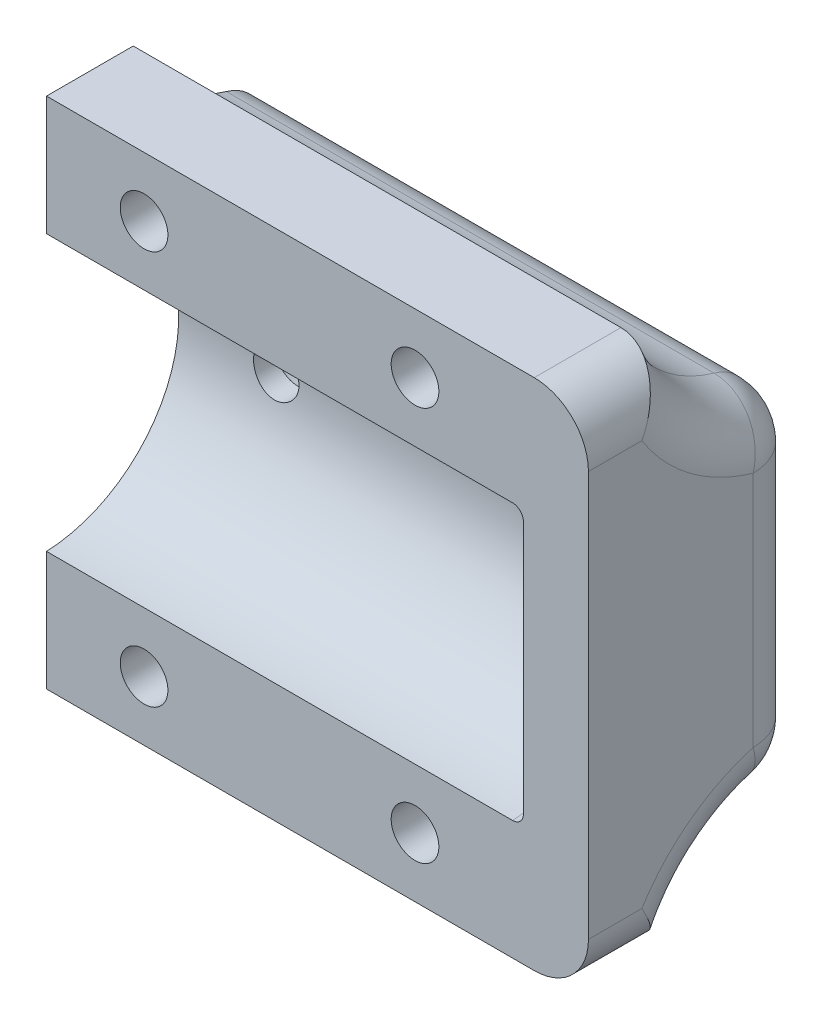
ISO-10303-21;
HEADER;
FILE_DESCRIPTION(('STEP AP214'),'2;1');
FILE_NAME('part.step','',(''),(''),'','','');
FILE_SCHEMA(('AUTOMOTIVE_DESIGN { 1 0 10303 214 1 1 1 1 }'));
ENDSEC;
DATA;
#1=APPLICATION_CONTEXT('core data for automotive mechanical design processes');
#2=APPLICATION_PROTOCOL_DEFINITION('international standard','automotive_design',2000,#1);
#3=PRODUCT_CONTEXT('',#1,'mechanical');
#4=PRODUCT('Part','Part','',(#3));
#5=PRODUCT_RELATED_PRODUCT_CATEGORY('part','',(#4));
#6=PRODUCT_DEFINITION_FORMATION('','',#4);
#7=PRODUCT_DEFINITION_CONTEXT('part definition',#1,'design');
#8=PRODUCT_DEFINITION('design','',#6,#7);
#9=PRODUCT_DEFINITION_SHAPE('','',#8);
#10=(LENGTH_UNIT() NAMED_UNIT(*) SI_UNIT(.MILLI.,.METRE.));
#11=(NAMED_UNIT(*) PLANE_ANGLE_UNIT() SI_UNIT($,.RADIAN.));
#12=(NAMED_UNIT(*) SI_UNIT($,.STERADIAN.) SOLID_ANGLE_UNIT());
#13=UNCERTAINTY_MEASURE_WITH_UNIT(LENGTH_MEASURE(1.E-05),#10,'distance_accuracy_value','');
#14=(GEOMETRIC_REPRESENTATION_CONTEXT(3) GLOBAL_UNCERTAINTY_ASSIGNED_CONTEXT((#13)) GLOBAL_UNIT_ASSIGNED_CONTEXT((#10,
#11,#12)) REPRESENTATION_CONTEXT('',''));
#15=CARTESIAN_POINT('',(0.,0.,0.));
#16=DIRECTION('',(0.,0.,1.));
#17=DIRECTION('',(1.,0.,0.));
#18=AXIS2_PLACEMENT_3D('',#15,#16,#17);
#19=CARTESIAN_POINT('',(9.,18.1901536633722,-20.2));
#20=DIRECTION('',(0.,0.,1.));
#21=DIRECTION('',(1.,0.,0.));
#22=AXIS2_PLACEMENT_3D('',#19,#20,#21);
#23=CYLINDRICAL_SURFACE('',#22,2.1);
#24=CARTESIAN_POINT('',(11.1,18.1901536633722,-11.9525931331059));
#25=CARTESIAN_POINT('',(11.1000004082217,18.2649816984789,-11.8609818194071));
#26=CARTESIAN_POINT('',(11.0960052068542,18.3410787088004,-11.7703655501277));
#27=CARTESIAN_POINT('',(11.079154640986,18.4953429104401,-11.5916495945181));
#28=CARTESIAN_POINT('',(11.0662941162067,18.5735112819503,-11.5035514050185));
#29=CARTESIAN_POINT('',(11.0307187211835,18.7311800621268,-11.3305862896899));
#30=CARTESIAN_POINT('',(11.008006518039,18.8106801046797,-11.2457184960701));
#31=CARTESIAN_POINT('',(10.9516676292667,18.9699774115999,-11.0800757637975));
#32=CARTESIAN_POINT('',(10.9180497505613,19.0497743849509,-10.9992975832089));
#33=CARTESIAN_POINT('',(10.8308817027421,19.2241599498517,-10.8271837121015));
#34=CARTESIAN_POINT('',(10.7746996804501,19.3185407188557,-10.7369349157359));
#35=CARTESIAN_POINT('',(10.6433310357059,19.5024767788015,-10.5659415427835));
#36=CARTESIAN_POINT('',(10.5681775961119,19.5920401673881,-10.4851807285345));
#37=CARTESIAN_POINT('',(10.4124724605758,19.7473465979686,-10.3485749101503));
#38=CARTESIAN_POINT('',(10.3350536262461,19.8145413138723,-10.2908319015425));
#39=CARTESIAN_POINT('',(10.1666705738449,19.9393955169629,-10.185421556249));
#40=CARTESIAN_POINT('',(10.0757076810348,19.9970559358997,-10.1377532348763));
#41=CARTESIAN_POINT('',(9.88077297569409,20.0997260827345,-10.0540279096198));
#42=CARTESIAN_POINT('',(9.77669657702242,20.1446234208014,-10.0180736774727));
#43=CARTESIAN_POINT('',(9.55915324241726,20.217581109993,-9.96014901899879));
#44=CARTESIAN_POINT('',(9.44569603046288,20.2456586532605,-9.93816431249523));
#45=CARTESIAN_POINT('',(9.23105328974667,20.2798029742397,-9.91150655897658));
#46=CARTESIAN_POINT('',(9.13053901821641,20.2885138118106,-9.90475177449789));
#47=CARTESIAN_POINT('',(8.92919774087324,20.291368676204,-9.90253351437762));
#48=CARTESIAN_POINT('',(8.8283709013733,20.2855194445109,-9.90706481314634));
#49=CARTESIAN_POINT('',(8.63670917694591,20.2605900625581,-9.9264973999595));
#50=CARTESIAN_POINT('',(8.54566955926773,20.2424669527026,-9.94064885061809));
#51=CARTESIAN_POINT('',(8.36851717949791,20.1950573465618,-9.97800381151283));
#52=CARTESIAN_POINT('',(8.28240458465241,20.1657704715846,-10.0012076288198));
#53=CARTESIAN_POINT('',(8.11351382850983,20.0961520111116,-10.057031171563));
#54=CARTESIAN_POINT('',(8.03102032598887,20.0554141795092,-10.0900002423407));
#55=CARTESIAN_POINT('',(7.87469363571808,19.9654928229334,-10.1638885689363));
#56=CARTESIAN_POINT('',(7.80086354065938,19.916306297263,-10.2048106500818));
#57=CARTESIAN_POINT('',(7.65342350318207,19.8045812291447,-10.2993903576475));
#58=CARTESIAN_POINT('',(7.58112519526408,19.7411373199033,-10.3540156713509));
#59=CARTESIAN_POINT('',(7.44864950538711,19.6086416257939,-10.4705997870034));
#60=CARTESIAN_POINT('',(7.38848087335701,19.539585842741,-10.5325638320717));
#61=CARTESIAN_POINT('',(7.24928027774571,19.3582334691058,-10.6991263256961));
#62=CARTESIAN_POINT('',(7.1786764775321,19.2434643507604,-10.8081002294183));
#63=CARTESIAN_POINT('',(7.06304899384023,19.0117757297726,-11.0368323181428));
#64=CARTESIAN_POINT('',(7.01808035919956,18.8948521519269,-11.1566130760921));
#65=CARTESIAN_POINT('',(6.96003177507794,18.6960820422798,-11.3684940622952));
#66=CARTESIAN_POINT('',(6.94151292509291,18.6137519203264,-11.458733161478));
#67=CARTESIAN_POINT('',(6.9146193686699,18.4509240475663,-11.6423762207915));
#68=CARTESIAN_POINT('',(6.90624901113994,18.3704270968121,-11.7357815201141));
#69=CARTESIAN_POINT('',(6.89860747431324,18.211798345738,-11.9252394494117));
#70=CARTESIAN_POINT('',(6.89935534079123,18.1336718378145,-12.02129720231));
#71=CARTESIAN_POINT('',(6.90909288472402,17.9803767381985,-12.215348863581));
#72=CARTESIAN_POINT('',(6.91808479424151,17.9052089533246,-12.3133432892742));
#73=CARTESIAN_POINT('',(6.94847966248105,17.7297495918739,-12.548910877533));
#74=CARTESIAN_POINT('',(6.97333321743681,17.6309580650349,-12.6871627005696));
#75=CARTESIAN_POINT('',(7.03594105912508,17.4401097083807,-12.9654428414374));
#76=CARTESIAN_POINT('',(7.07370249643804,17.3480566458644,-13.1054721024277));
#77=CARTESIAN_POINT('',(7.16111607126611,17.1712270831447,-13.3858891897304));
#78=CARTESIAN_POINT('',(7.21073913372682,17.0864334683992,-13.5262753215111));
#79=CARTESIAN_POINT('',(7.32164906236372,16.9241337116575,-13.8065398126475));
#80=CARTESIAN_POINT('',(7.38292820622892,16.8466227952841,-13.9464184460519));
#81=CARTESIAN_POINT('',(7.50653107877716,16.7114833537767,-14.2008953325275));
#82=CARTESIAN_POINT('',(7.56695979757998,16.6526994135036,-14.3158028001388));
#83=CARTESIAN_POINT('',(7.69768262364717,16.5404745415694,-14.5431696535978));
#84=CARTESIAN_POINT('',(7.76800164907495,16.4870477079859,-14.6556220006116));
#85=CARTESIAN_POINT('',(7.88295871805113,16.4112939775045,-14.8208015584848));
#86=CARTESIAN_POINT('',(7.92311995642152,16.386643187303,-14.8755872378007));
#87=CARTESIAN_POINT('',(8.00703452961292,16.3391136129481,-14.9831227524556));
#88=CARTESIAN_POINT('',(8.0507860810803,16.316233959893,-15.0358735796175));
#89=CARTESIAN_POINT('',(8.14233999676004,16.2726083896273,-15.1382052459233));
#90=CARTESIAN_POINT('',(8.19012175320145,16.2518526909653,-15.1878001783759));
#91=CARTESIAN_POINT('',(8.29073639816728,16.2128182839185,-15.282583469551));
#92=CARTESIAN_POINT('',(8.34355978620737,16.1945350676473,-15.327779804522));
#93=CARTESIAN_POINT('',(8.44011950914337,16.1657201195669,-15.4000154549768));
#94=CARTESIAN_POINT('',(8.48242076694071,16.154432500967,-15.4286501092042));
#95=CARTESIAN_POINT('',(8.57060452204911,16.1340245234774,-15.4808751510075));
#96=CARTESIAN_POINT('',(8.61648761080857,16.1249045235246,-15.5044647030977));
#97=CARTESIAN_POINT('',(8.71244367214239,16.1093604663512,-15.5449251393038));
#98=CARTESIAN_POINT('',(8.76256654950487,16.1029761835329,-15.5616967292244));
#99=CARTESIAN_POINT('',(8.86533402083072,16.09384669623,-15.5857480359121));
#100=CARTESIAN_POINT('',(8.9179716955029,16.0910920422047,-15.5930523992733));
#101=CARTESIAN_POINT('',(9.01742427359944,16.0897076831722,-15.5967198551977));
#102=CARTESIAN_POINT('',(9.06419041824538,16.0906280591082,-15.5942763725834));
#103=CARTESIAN_POINT('',(9.15647273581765,16.0954799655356,-15.5814486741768));
#104=CARTESIAN_POINT('',(9.2019873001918,16.099415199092,-15.5710546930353));
#105=CARTESIAN_POINT('',(9.30132155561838,16.1111440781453,-15.5402783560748));
#106=CARTESIAN_POINT('',(9.35448350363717,16.1196412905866,-15.5180867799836));
#107=CARTESIAN_POINT('',(9.45643323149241,16.1396935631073,-15.466303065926));
#108=CARTESIAN_POINT('',(9.50521035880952,16.1512558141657,-15.4366935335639));
#109=CARTESIAN_POINT('',(9.59370830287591,16.1753614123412,-15.3757510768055));
#110=CARTESIAN_POINT('',(9.63384350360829,16.1876779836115,-15.3449169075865));
#111=CARTESIAN_POINT('',(9.71115189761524,16.2138120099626,-15.2802852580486));
#112=CARTESIAN_POINT('',(9.74832251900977,16.2276307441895,-15.2464852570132));
#113=CARTESIAN_POINT('',(9.85609061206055,16.2710027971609,-15.1417608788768));
#114=CARTESIAN_POINT('',(9.92279602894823,16.3024287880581,-15.0676226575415));
#115=CARTESIAN_POINT('',(10.0559206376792,16.3731851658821,-14.9052652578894));
#116=CARTESIAN_POINT('',(10.1212987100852,16.4130123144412,-14.8164349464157));
#117=CARTESIAN_POINT('',(10.2442408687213,16.4968163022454,-14.6352855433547));
#118=CARTESIAN_POINT('',(10.3017961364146,16.540797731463,-14.5429626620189));
#119=CARTESIAN_POINT('',(10.4103940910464,16.6326381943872,-14.3560848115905));
#120=CARTESIAN_POINT('',(10.4614192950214,16.6805070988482,-14.2615246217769));
#121=CARTESIAN_POINT('',(10.5574926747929,16.7798395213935,-14.0712530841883));
#122=CARTESIAN_POINT('',(10.6025395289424,16.8313038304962,-13.9755414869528));
#123=CARTESIAN_POINT('',(10.7074136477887,16.9634097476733,-13.7372076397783));
#124=CARTESIAN_POINT('',(10.7638752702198,17.0461410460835,-13.5942491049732));
#125=CARTESIAN_POINT('',(10.8646655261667,17.2190559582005,-13.3084330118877));
#126=CARTESIAN_POINT('',(10.9089860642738,17.3092444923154,-13.1655755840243));
#127=CARTESIAN_POINT('',(10.9846343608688,17.4963501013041,-12.8818015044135));
#128=CARTESIAN_POINT('',(11.0160208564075,17.5932343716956,-12.7408789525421));
#129=CARTESIAN_POINT('',(11.0648004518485,17.793645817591,-12.4614810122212));
#130=CARTESIAN_POINT('',(11.0822089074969,17.8971655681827,-12.3230031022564));
#131=CARTESIAN_POINT('',(11.0944283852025,18.0342349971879,-12.1471010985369));
#132=CARTESIAN_POINT('',(11.0965021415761,18.0650709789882,-12.1079938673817));
#133=CARTESIAN_POINT('',(11.0992886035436,18.1272469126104,-12.0300628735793));
#134=CARTESIAN_POINT('',(11.0999998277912,18.1585873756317,-11.9912394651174));
#135=CARTESIAN_POINT('',(11.1,18.1901536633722,-11.9525931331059));
#136=B_SPLINE_CURVE_WITH_KNOTS('',3,(#24,#25,#26,#27,#28,#29,#30,#31,#32,#33,#34,#35,#36,#37,
#38,#39,#40,#41,#42,#43,#44,#45,#46,#47,#48,#49,#50,#51,#52,#53,#54,#55,#56,#57,#58,#59,#60,#61,
#62,#63,#64,#65,#66,#67,#68,#69,#70,#71,#72,#73,#74,#75,#76,#77,#78,#79,#80,#81,#82,#83,#84,#85,
#86,#87,#88,#89,#90,#91,#92,#93,#94,#95,#96,#97,#98,#99,#100,#101,#102,#103,#104,#105,#106,#107,
#108,#109,#110,#111,#112,#113,#114,#115,#116,#117,#118,#119,#120,#121,#122,#123,#124,#125,#126,
#127,#128,#129,#130,#131,#132,#133,#134,#135),.UNSPECIFIED.,.T.,.F.,(4,2,2,2,2,2,2,2,2,2,2,2,2,
2,2,2,2,2,2,2,2,2,2,2,2,2,2,2,2,2,2,2,2,2,2,2,2,2,2,2,2,2,2,2,2,2,2,2,2,2,2,2,2,2,2,4),(0.,
0.354821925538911,0.709850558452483,1.06478313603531,1.41942979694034,1.84446916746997,
2.26877019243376,2.62034948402,2.97189439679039,3.32644530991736,3.6806332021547,
3.98236309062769,4.2839533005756,4.56438465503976,4.84482552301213,5.13685035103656,
5.42897911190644,5.75961189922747,6.09048234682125,6.60747457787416,7.12557285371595,
7.49574693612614,7.86607959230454,8.23718591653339,8.60839274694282,9.12286436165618,
9.63762144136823,10.15112946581,10.6642984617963,11.0914931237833,11.5197840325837,
11.7364714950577,11.9530519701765,12.168585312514,12.3837202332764,12.5403530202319,
12.6970117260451,12.8558765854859,13.014327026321,13.1540104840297,13.2938657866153,
13.4675871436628,13.6417197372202,13.7977587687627,13.9539317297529,14.2668418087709,
14.618178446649,14.9699079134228,15.3225601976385,15.675290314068,16.1983356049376,
16.7217288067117,17.2427182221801,17.7631345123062,17.9126540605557,18.062336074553),.UNSPECIFIED.);
#137=CARTESIAN_POINT('',(11.1,18.1901536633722,-11.9525931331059));
#138=VERTEX_POINT('',#137);
#139=EDGE_CURVE('E281',#138,#138,#136,.T.);
#140=ORIENTED_EDGE('',*,*,#139,.F.);
#141=EDGE_LOOP('',(#140));
#142=FACE_BOUND('',#141,.T.);
#143=CARTESIAN_POINT('',(9.,18.1901536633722,-5.));
#144=DIRECTION('',(0.,0.,1.));
#145=DIRECTION('',(1.,0.,0.));
#146=AXIS2_PLACEMENT_3D('',#143,#144,#145);
#147=CIRCLE('',#146,2.1);
#148=CARTESIAN_POINT('',(11.1,18.1901536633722,-5.));
#149=VERTEX_POINT('',#148);
#150=EDGE_CURVE('E408',#149,#149,#147,.F.);
#151=ORIENTED_EDGE('',*,*,#150,.F.);
#152=EDGE_LOOP('',(#151));
#153=FACE_BOUND('',#152,.T.);
#154=ADVANCED_FACE('F42',(#142,#153),#23,.F.);
#155=CARTESIAN_POINT('',(34.,-18.1901536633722,-20.2));
#156=DIRECTION('',(0.,0.,1.));
#157=DIRECTION('',(1.,0.,0.));
#158=AXIS2_PLACEMENT_3D('',#155,#156,#157);
#159=CYLINDRICAL_SURFACE('',#158,2.1);
#160=CARTESIAN_POINT('',(36.1,-18.1901536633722,-11.9525931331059));
#161=CARTESIAN_POINT('',(36.100002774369,-18.0940217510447,-12.0702912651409));
#162=CARTESIAN_POINT('',(36.0934104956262,-17.9999131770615,-12.1897181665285));
#163=CARTESIAN_POINT('',(36.0685563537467,-17.8164509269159,-12.4310664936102));
#164=CARTESIAN_POINT('',(36.0502835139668,-17.7271018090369,-12.5529901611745));
#165=CARTESIAN_POINT('',(36.0030754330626,-17.5530775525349,-12.799241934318));
#166=CARTESIAN_POINT('',(35.9740755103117,-17.4684344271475,-12.9235801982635));
#167=CARTESIAN_POINT('',(35.9062633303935,-17.3047106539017,-13.1731361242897));
#168=CARTESIAN_POINT('',(35.8674552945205,-17.2256276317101,-13.2983533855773));
#169=CARTESIAN_POINT('',(35.7780373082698,-17.0689165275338,-13.5559370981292));
#170=CARTESIAN_POINT('',(35.7268925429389,-16.9916118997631,-13.6883152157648));
#171=CARTESIAN_POINT('',(35.614024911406,-16.8434507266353,-13.9523654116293));
#172=CARTESIAN_POINT('',(35.5522914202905,-16.7726007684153,-14.084036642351));
#173=CARTESIAN_POINT('',(35.4177380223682,-16.6380390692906,-14.3444353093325));
#174=CARTESIAN_POINT('',(35.3449763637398,-16.574292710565,-14.4731743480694));
#175=CARTESIAN_POINT('',(35.2257392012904,-16.4842757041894,-14.6623940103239));
#176=CARTESIAN_POINT('',(35.184346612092,-16.4552239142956,-14.7247727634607));
#177=CARTESIAN_POINT('',(35.0976680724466,-16.399121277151,-14.8476833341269));
#178=CARTESIAN_POINT('',(35.0523841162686,-16.3720694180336,-14.9082160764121));
#179=CARTESIAN_POINT('',(34.9748896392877,-16.3298454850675,-15.0045736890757));
#180=CARTESIAN_POINT('',(34.9440728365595,-16.3139938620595,-15.0412225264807));
#181=CARTESIAN_POINT('',(34.8803646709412,-16.283268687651,-15.1131282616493));
#182=CARTESIAN_POINT('',(34.847472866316,-16.2683953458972,-15.1483848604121));
#183=CARTESIAN_POINT('',(34.7794212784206,-16.2398046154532,-15.2169564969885));
#184=CARTESIAN_POINT('',(34.7442675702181,-16.2260843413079,-15.2502763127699));
#185=CARTESIAN_POINT('',(34.6713037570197,-16.199964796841,-15.3144084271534));
#186=CARTESIAN_POINT('',(34.6334954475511,-16.1875646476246,-15.3452223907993));
#187=CARTESIAN_POINT('',(34.5509635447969,-16.1632174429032,-15.4063298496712));
#188=CARTESIAN_POINT('',(34.5059256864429,-16.151435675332,-15.4362723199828));
#189=CARTESIAN_POINT('',(34.4118604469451,-16.1303757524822,-15.4902768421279));
#190=CARTESIAN_POINT('',(34.3628373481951,-16.1210949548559,-15.5143450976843));
#191=CARTESIAN_POINT('',(34.2702128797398,-16.1071844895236,-15.5506399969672));
#192=CARTESIAN_POINT('',(34.2272345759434,-16.1020171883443,-15.5642210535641));
#193=CARTESIAN_POINT('',(34.1394620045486,-16.0943286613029,-15.5844806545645));
#194=CARTESIAN_POINT('',(34.0946705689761,-16.0918034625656,-15.59116956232));
#195=CARTESIAN_POINT('',(34.0043045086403,-16.0896702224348,-15.5968178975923));
#196=CARTESIAN_POINT('',(33.9587272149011,-16.090075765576,-15.5957413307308));
#197=CARTESIAN_POINT('',(33.868520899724,-16.0937858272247,-15.5859254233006));
#198=CARTESIAN_POINT('',(33.8238928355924,-16.097093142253,-15.5771786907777));
#199=CARTESIAN_POINT('',(33.726945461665,-16.1072888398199,-15.5503739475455));
#200=CARTESIAN_POINT('',(33.6751610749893,-16.1148165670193,-15.5306610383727));
#201=CARTESIAN_POINT('',(33.5755980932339,-16.1328598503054,-15.4838919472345));
#202=CARTESIAN_POINT('',(33.5278292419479,-16.1433824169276,-15.4568185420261));
#203=CARTESIAN_POINT('',(33.4024008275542,-16.1752954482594,-15.3757041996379));
#204=CARTESIAN_POINT('',(33.3287147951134,-16.1989735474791,-15.3165116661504));
#205=CARTESIAN_POINT('',(33.1907907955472,-16.2509220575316,-15.189824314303));
#206=CARTESIAN_POINT('',(33.1265834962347,-16.2792067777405,-15.1223037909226));
#207=CARTESIAN_POINT('',(32.9987070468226,-16.342707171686,-14.974543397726));
#208=CARTESIAN_POINT('',(32.9359212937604,-16.3783449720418,-14.8937288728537));
#209=CARTESIAN_POINT('',(32.8175149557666,-16.4533074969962,-14.7285800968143));
#210=CARTESIAN_POINT('',(32.7619024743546,-16.4926363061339,-14.6442420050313));
#211=CARTESIAN_POINT('',(32.6565918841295,-16.5746922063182,-14.4732710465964));
#212=CARTESIAN_POINT('',(32.606907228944,-16.6174266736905,-14.3866334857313));
#213=CARTESIAN_POINT('',(32.5128745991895,-16.7060287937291,-14.212063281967));
#214=CARTESIAN_POINT('',(32.468528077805,-16.7518972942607,-14.1241302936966));
#215=CARTESIAN_POINT('',(32.3587641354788,-16.8760511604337,-13.8927485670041));
#216=CARTESIAN_POINT('',(32.297343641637,-16.9567929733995,-13.748703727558));
#217=CARTESIAN_POINT('',(32.1868139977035,-17.1259390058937,-13.4602836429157));
#218=CARTESIAN_POINT('',(32.1377128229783,-17.214348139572,-13.3159082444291));
#219=CARTESIAN_POINT('',(32.0523311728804,-17.3984085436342,-13.0283206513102));
#220=CARTESIAN_POINT('',(32.0160297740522,-17.4940476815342,-12.8851069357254));
#221=CARTESIAN_POINT('',(31.9572461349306,-17.6923194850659,-12.600768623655));
#222=CARTESIAN_POINT('',(31.9347547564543,-17.7949474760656,-12.4596427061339));
#223=CARTESIAN_POINT('',(31.9104341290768,-17.9697843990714,-12.2291816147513));
#224=CARTESIAN_POINT('',(31.9041388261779,-18.0401551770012,-12.138908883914));
#225=CARTESIAN_POINT('',(31.8987878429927,-18.1833865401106,-11.960089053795));
#226=CARTESIAN_POINT('',(31.8997334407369,-18.256247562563,-11.8715422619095));
#227=CARTESIAN_POINT('',(31.9096034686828,-18.4039577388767,-11.6967795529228));
#228=CARTESIAN_POINT('',(31.918515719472,-18.4788036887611,-11.6105602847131));
#229=CARTESIAN_POINT('',(31.945151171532,-18.630028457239,-11.4408760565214));
#230=CARTESIAN_POINT('',(31.9628737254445,-18.7064071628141,-11.3574108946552));
#231=CARTESIAN_POINT('',(32.0185967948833,-18.8957075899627,-11.1558189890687));
#232=CARTESIAN_POINT('',(32.0621933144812,-19.0091176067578,-11.0396084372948));
#233=CARTESIAN_POINT('',(32.1735260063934,-19.2340346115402,-10.817266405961));
#234=CARTESIAN_POINT('',(32.2412305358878,-19.345543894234,-10.7111219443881));
#235=CARTESIAN_POINT('',(32.3843524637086,-19.5356281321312,-10.5359771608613));
#236=CARTESIAN_POINT('',(32.4541763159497,-19.6157637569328,-10.4641234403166));
#237=CARTESIAN_POINT('',(32.610166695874,-19.768194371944,-10.3304693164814));
#238=CARTESIAN_POINT('',(32.6963132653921,-19.8404987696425,-10.2686568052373));
#239=CARTESIAN_POINT('',(32.8685503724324,-19.9618675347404,-10.1668048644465));
#240=CARTESIAN_POINT('',(32.9521889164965,-20.0127943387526,-10.1248511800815));
#241=CARTESIAN_POINT('',(33.129289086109,-20.1037240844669,-10.0508526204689));
#242=CARTESIAN_POINT('',(33.2227474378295,-20.1437306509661,-10.0188044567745));
#243=CARTESIAN_POINT('',(33.4179258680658,-20.2105207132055,-9.96573471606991));
#244=CARTESIAN_POINT('',(33.5196901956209,-20.2372271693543,-9.94477733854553));
#245=CARTESIAN_POINT('',(33.7278054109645,-20.2751180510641,-9.91514433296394));
#246=CARTESIAN_POINT('',(33.8341541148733,-20.2863097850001,-9.90646292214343));
#247=CARTESIAN_POINT('',(34.0366479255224,-20.2920236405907,-9.90202559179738));
#248=CARTESIAN_POINT('',(34.1327262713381,-20.2881309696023,-9.90504055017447));
#249=CARTESIAN_POINT('',(34.3225911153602,-20.2674231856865,-9.92116439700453));
#250=CARTESIAN_POINT('',(34.4163780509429,-20.2506105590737,-9.93427134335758));
#251=CARTESIAN_POINT('',(34.5974377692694,-20.2055009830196,-9.96974995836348));
#252=CARTESIAN_POINT('',(34.6847967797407,-20.1774137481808,-9.99195258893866));
#253=CARTESIAN_POINT('',(34.852892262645,-20.1112835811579,-10.0448432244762));
#254=CARTESIAN_POINT('',(34.9336274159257,-20.073238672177,-10.0755329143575));
#255=CARTESIAN_POINT('',(35.0935007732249,-19.9854926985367,-10.1473346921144));
#256=CARTESIAN_POINT('',(35.1719581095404,-19.9350890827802,-10.1890976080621));
#257=CARTESIAN_POINT('',(35.3187149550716,-19.8270147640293,-10.2802635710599));
#258=CARTESIAN_POINT('',(35.3870091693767,-19.7693403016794,-10.3296705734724));
#259=CARTESIAN_POINT('',(35.5423015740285,-19.6210739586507,-10.4592301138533));
#260=CARTESIAN_POINT('',(35.6234437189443,-19.5275480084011,-10.5430681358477));
#261=CARTESIAN_POINT('',(35.7646603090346,-19.3348454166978,-10.7214260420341));
#262=CARTESIAN_POINT('',(35.8246818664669,-19.2356553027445,-10.8159719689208));
#263=CARTESIAN_POINT('',(35.9451724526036,-18.9967063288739,-11.0514988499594));
#264=CARTESIAN_POINT('',(35.996724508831,-18.8561825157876,-11.1962312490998));
#265=CARTESIAN_POINT('',(36.068685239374,-18.5788492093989,-11.4959765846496));
#266=CARTESIAN_POINT('',(36.089108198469,-18.4420380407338,-11.6509847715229));
#267=CARTESIAN_POINT('',(36.0988988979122,-18.2689700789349,-11.8567958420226));
#268=CARTESIAN_POINT('',(36.0999988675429,-18.2293933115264,-11.9045504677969));
#269=CARTESIAN_POINT('',(36.1,-18.1901536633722,-11.9525931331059));
#270=B_SPLINE_CURVE_WITH_KNOTS('',3,(#160,#161,#162,#163,#164,#165,#166,#167,#168,#169,#170,
#171,#172,#173,#174,#175,#176,#177,#178,#179,#180,#181,#182,#183,#184,#185,#186,#187,#188,#189,
#190,#191,#192,#193,#194,#195,#196,#197,#198,#199,#200,#201,#202,#203,#204,#205,#206,#207,#208,
#209,#210,#211,#212,#213,#214,#215,#216,#217,#218,#219,#220,#221,#222,#223,#224,#225,#226,#227,
#228,#229,#230,#231,#232,#233,#234,#235,#236,#237,#238,#239,#240,#241,#242,#243,#244,#245,#246,
#247,#248,#249,#250,#251,#252,#253,#254,#255,#256,#257,#258,#259,#260,#261,#262,#263,#264,#265,
#266,#267,#268,#269),.UNSPECIFIED.,.T.,.F.,(4,2,2,2,2,2,2,2,2,2,2,2,2,2,2,2,2,2,2,2,2,2,2,2,2,2,
2,2,2,2,2,2,2,2,2,2,2,2,2,2,2,2,2,2,2,2,2,2,2,2,2,2,2,2,4),(0.,0.455877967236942,
0.912184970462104,1.37128947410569,1.83019672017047,2.31453335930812,2.79935886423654,
3.28170754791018,3.52251308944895,3.76319594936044,3.9144562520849,4.06574886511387,
4.21665084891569,4.36745173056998,4.53312465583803,4.6986218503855,4.8341861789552,
4.96954636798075,5.10553437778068,5.24165358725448,5.40846713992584,5.57567443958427,
5.86634597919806,6.1579382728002,6.48253321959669,6.8074917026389,7.13317421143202,
7.45894518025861,7.98682932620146,8.51505434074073,9.04241183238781,9.56941999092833,
9.91308938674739,10.2568194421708,10.6000249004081,10.9432051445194,11.4458568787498,
11.9478512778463,12.3313441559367,12.7143711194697,13.0326529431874,13.3508289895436,
13.6708272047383,13.9906746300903,14.2778676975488,14.5650055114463,14.8470330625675,
15.1291166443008,15.4344648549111,15.7399715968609,16.1860724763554,16.6332826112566,
17.2545398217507,17.8755118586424,18.0615946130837),.UNSPECIFIED.);
#271=CARTESIAN_POINT('',(36.1,-18.1901536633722,-11.9525931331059));
#272=VERTEX_POINT('',#271);
#273=EDGE_CURVE('E340',#272,#272,#270,.T.);
#274=ORIENTED_EDGE('',*,*,#273,.F.);
#275=EDGE_LOOP('',(#274));
#276=FACE_BOUND('',#275,.T.);
#277=CARTESIAN_POINT('',(34.,-18.1901536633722,-5.));
#278=DIRECTION('',(0.,0.,1.));
#279=DIRECTION('',(1.,0.,0.));
#280=AXIS2_PLACEMENT_3D('',#277,#278,#279);
#281=CIRCLE('',#280,2.1);
#282=CARTESIAN_POINT('',(36.1,-18.1901536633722,-5.));
#283=VERTEX_POINT('',#282);
#284=EDGE_CURVE('E409',#283,#283,#281,.F.);
#285=ORIENTED_EDGE('',*,*,#284,.F.);
#286=EDGE_LOOP('',(#285));
#287=FACE_BOUND('',#286,.T.);
#288=ADVANCED_FACE('F311',(#276,#287),#159,.F.);
#289=CARTESIAN_POINT('',(9.,-18.1901536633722,-20.2));
#290=DIRECTION('',(0.,0.,1.));
#291=DIRECTION('',(1.,0.,0.));
#292=AXIS2_PLACEMENT_3D('',#289,#290,#291);
#293=CYLINDRICAL_SURFACE('',#292,2.1);
#294=CARTESIAN_POINT('',(11.1,-18.1901536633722,-11.9525931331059));
#295=CARTESIAN_POINT('',(11.100002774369,-18.0940217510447,-12.0702912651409));
#296=CARTESIAN_POINT('',(11.0934104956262,-17.9999131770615,-12.1897181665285));
#297=CARTESIAN_POINT('',(11.0685563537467,-17.8164509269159,-12.4310664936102));
#298=CARTESIAN_POINT('',(11.0502835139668,-17.7271018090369,-12.5529901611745));
#299=CARTESIAN_POINT('',(11.0030754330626,-17.5530775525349,-12.799241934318));
#300=CARTESIAN_POINT('',(10.9740755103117,-17.4684344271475,-12.9235801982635));
#301=CARTESIAN_POINT('',(10.9062633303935,-17.3047106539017,-13.1731361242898));
#302=CARTESIAN_POINT('',(10.8674552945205,-17.2256276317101,-13.2983533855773));
#303=CARTESIAN_POINT('',(10.7780373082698,-17.0689165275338,-13.5559370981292));
#304=CARTESIAN_POINT('',(10.7268925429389,-16.9916118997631,-13.6883152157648));
#305=CARTESIAN_POINT('',(10.614024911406,-16.8434507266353,-13.9523654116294));
#306=CARTESIAN_POINT('',(10.5522914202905,-16.7726007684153,-14.084036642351));
#307=CARTESIAN_POINT('',(10.4177380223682,-16.6380390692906,-14.3444353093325));
#308=CARTESIAN_POINT('',(10.3449763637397,-16.574292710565,-14.4731743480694));
#309=CARTESIAN_POINT('',(10.2257392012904,-16.4842757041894,-14.662394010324));
#310=CARTESIAN_POINT('',(10.184346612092,-16.4552239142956,-14.7247727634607));
#311=CARTESIAN_POINT('',(10.0976680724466,-16.399121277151,-14.847683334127));
#312=CARTESIAN_POINT('',(10.0523841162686,-16.3720694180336,-14.9082160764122));
#313=CARTESIAN_POINT('',(9.97488963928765,-16.3298454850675,-15.0045736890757));
#314=CARTESIAN_POINT('',(9.94407283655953,-16.3139938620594,-15.0412225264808));
#315=CARTESIAN_POINT('',(9.88036467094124,-16.283268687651,-15.1131282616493));
#316=CARTESIAN_POINT('',(9.84747286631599,-16.2683953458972,-15.1483848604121));
#317=CARTESIAN_POINT('',(9.77942127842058,-16.2398046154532,-15.2169564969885));
#318=CARTESIAN_POINT('',(9.74426757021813,-16.2260843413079,-15.2502763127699));
#319=CARTESIAN_POINT('',(9.67130375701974,-16.199964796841,-15.3144084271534));
#320=CARTESIAN_POINT('',(9.63349544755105,-16.1875646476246,-15.3452223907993));
#321=CARTESIAN_POINT('',(9.55096354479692,-16.1632174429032,-15.4063298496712));
#322=CARTESIAN_POINT('',(9.50592568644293,-16.151435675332,-15.4362723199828));
#323=CARTESIAN_POINT('',(9.41186044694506,-16.1303757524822,-15.4902768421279));
#324=CARTESIAN_POINT('',(9.36283734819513,-16.1210949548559,-15.5143450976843));
#325=CARTESIAN_POINT('',(9.27021287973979,-16.1071844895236,-15.5506399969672));
#326=CARTESIAN_POINT('',(9.22723457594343,-16.1020171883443,-15.5642210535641));
#327=CARTESIAN_POINT('',(9.1394620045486,-16.0943286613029,-15.5844806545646));
#328=CARTESIAN_POINT('',(9.09467056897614,-16.0918034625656,-15.59116956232));
#329=CARTESIAN_POINT('',(9.00430450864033,-16.0896702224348,-15.5968178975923));
#330=CARTESIAN_POINT('',(8.95872721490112,-16.090075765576,-15.5957413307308));
#331=CARTESIAN_POINT('',(8.86852089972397,-16.0937858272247,-15.5859254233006));
#332=CARTESIAN_POINT('',(8.8238928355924,-16.097093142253,-15.5771786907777));
#333=CARTESIAN_POINT('',(8.72694546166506,-16.1072888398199,-15.5503739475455));
#334=CARTESIAN_POINT('',(8.67516107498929,-16.1148165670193,-15.5306610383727));
#335=CARTESIAN_POINT('',(8.57559809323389,-16.1328598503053,-15.4838919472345));
#336=CARTESIAN_POINT('',(8.52782924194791,-16.1433824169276,-15.4568185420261));
#337=CARTESIAN_POINT('',(8.40240082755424,-16.1752954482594,-15.3757041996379));
#338=CARTESIAN_POINT('',(8.32871479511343,-16.1989735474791,-15.3165116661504));
#339=CARTESIAN_POINT('',(8.19079079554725,-16.2509220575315,-15.189824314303));
#340=CARTESIAN_POINT('',(8.12658349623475,-16.2792067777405,-15.1223037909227));
#341=CARTESIAN_POINT('',(7.99870704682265,-16.342707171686,-14.974543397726));
#342=CARTESIAN_POINT('',(7.93592129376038,-16.3783449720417,-14.8937288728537));
#343=CARTESIAN_POINT('',(7.81751495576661,-16.4533074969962,-14.7285800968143));
#344=CARTESIAN_POINT('',(7.76190247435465,-16.4926363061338,-14.6442420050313));
#345=CARTESIAN_POINT('',(7.65659188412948,-16.5746922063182,-14.4732710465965));
#346=CARTESIAN_POINT('',(7.60690722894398,-16.6174266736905,-14.3866334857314));
#347=CARTESIAN_POINT('',(7.51287459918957,-16.7060287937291,-14.212063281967));
#348=CARTESIAN_POINT('',(7.468528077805,-16.7518972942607,-14.1241302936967));
#349=CARTESIAN_POINT('',(7.3587641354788,-16.8760511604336,-13.8927485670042));
#350=CARTESIAN_POINT('',(7.29734364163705,-16.9567929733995,-13.748703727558));
#351=CARTESIAN_POINT('',(7.18681399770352,-17.1259390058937,-13.4602836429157));
#352=CARTESIAN_POINT('',(7.13771282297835,-17.214348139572,-13.3159082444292));
#353=CARTESIAN_POINT('',(7.05233117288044,-17.3984085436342,-13.0283206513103));
#354=CARTESIAN_POINT('',(7.01602977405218,-17.4940476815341,-12.8851069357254));
#355=CARTESIAN_POINT('',(6.95724613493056,-17.6923194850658,-12.6007686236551));
#356=CARTESIAN_POINT('',(6.93475475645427,-17.7949474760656,-12.459642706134));
#357=CARTESIAN_POINT('',(6.91043412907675,-17.9697843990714,-12.2291816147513));
#358=CARTESIAN_POINT('',(6.90413882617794,-18.0401551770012,-12.1389088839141));
#359=CARTESIAN_POINT('',(6.89878784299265,-18.1833865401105,-11.9600890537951));
#360=CARTESIAN_POINT('',(6.89973344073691,-18.2562475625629,-11.8715422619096));
#361=CARTESIAN_POINT('',(6.90960346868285,-18.4039577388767,-11.6967795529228));
#362=CARTESIAN_POINT('',(6.91851571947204,-18.478803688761,-11.6105602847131));
#363=CARTESIAN_POINT('',(6.94515117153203,-18.630028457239,-11.4408760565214));
#364=CARTESIAN_POINT('',(6.96287372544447,-18.706407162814,-11.3574108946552));
#365=CARTESIAN_POINT('',(7.01859679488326,-18.8957075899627,-11.1558189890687));
#366=CARTESIAN_POINT('',(7.06219331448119,-19.0091176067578,-11.0396084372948));
#367=CARTESIAN_POINT('',(7.17352600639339,-19.2340346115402,-10.817266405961));
#368=CARTESIAN_POINT('',(7.24123053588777,-19.345543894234,-10.7111219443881));
#369=CARTESIAN_POINT('',(7.38435246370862,-19.5356281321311,-10.5359771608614));
#370=CARTESIAN_POINT('',(7.45417631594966,-19.6157637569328,-10.4641234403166));
#371=CARTESIAN_POINT('',(7.610166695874,-19.768194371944,-10.3304693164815));
#372=CARTESIAN_POINT('',(7.69631326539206,-19.8404987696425,-10.2686568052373));
#373=CARTESIAN_POINT('',(7.86855037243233,-19.9618675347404,-10.1668048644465));
#374=CARTESIAN_POINT('',(7.9521889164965,-20.0127943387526,-10.1248511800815));
#375=CARTESIAN_POINT('',(8.12928908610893,-20.1037240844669,-10.0508526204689));
#376=CARTESIAN_POINT('',(8.22274743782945,-20.1437306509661,-10.0188044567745));
#377=CARTESIAN_POINT('',(8.41792586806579,-20.2105207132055,-9.96573471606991));
#378=CARTESIAN_POINT('',(8.5196901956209,-20.2372271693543,-9.94477733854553));
#379=CARTESIAN_POINT('',(8.72780541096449,-20.2751180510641,-9.91514433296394));
#380=CARTESIAN_POINT('',(8.8341541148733,-20.2863097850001,-9.90646292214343));
#381=CARTESIAN_POINT('',(9.03664792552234,-20.2920236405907,-9.90202559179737));
#382=CARTESIAN_POINT('',(9.13272627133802,-20.2881309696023,-9.90504055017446));
#383=CARTESIAN_POINT('',(9.3225911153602,-20.2674231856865,-9.92116439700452));
#384=CARTESIAN_POINT('',(9.41637805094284,-20.2506105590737,-9.93427134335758));
#385=CARTESIAN_POINT('',(9.59743776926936,-20.2055009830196,-9.96974995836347));
#386=CARTESIAN_POINT('',(9.68479677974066,-20.1774137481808,-9.99195258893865));
#387=CARTESIAN_POINT('',(9.85289226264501,-20.1112835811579,-10.0448432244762));
#388=CARTESIAN_POINT('',(9.93362741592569,-20.073238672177,-10.0755329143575));
#389=CARTESIAN_POINT('',(10.0935007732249,-19.9854926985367,-10.1473346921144));
#390=CARTESIAN_POINT('',(10.1719581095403,-19.9350890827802,-10.1890976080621));
#391=CARTESIAN_POINT('',(10.3187149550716,-19.8270147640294,-10.2802635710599));
#392=CARTESIAN_POINT('',(10.3870091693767,-19.7693403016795,-10.3296705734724));
#393=CARTESIAN_POINT('',(10.5423015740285,-19.6210739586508,-10.4592301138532));
#394=CARTESIAN_POINT('',(10.6234437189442,-19.5275480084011,-10.5430681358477));
#395=CARTESIAN_POINT('',(10.7646603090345,-19.3348454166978,-10.721426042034));
#396=CARTESIAN_POINT('',(10.8246818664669,-19.2356553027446,-10.8159719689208));
#397=CARTESIAN_POINT('',(10.9451724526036,-18.9967063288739,-11.0514988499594));
#398=CARTESIAN_POINT('',(10.9967245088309,-18.8561825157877,-11.1962312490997));
#399=CARTESIAN_POINT('',(11.068685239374,-18.5788492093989,-11.4959765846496));
#400=CARTESIAN_POINT('',(11.089108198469,-18.4420380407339,-11.6509847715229));
#401=CARTESIAN_POINT('',(11.0988988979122,-18.268970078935,-11.8567958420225));
#402=CARTESIAN_POINT('',(11.0999988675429,-18.2293933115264,-11.9045504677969));
#403=CARTESIAN_POINT('',(11.1,-18.1901536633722,-11.9525931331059));
#404=B_SPLINE_CURVE_WITH_KNOTS('',3,(#294,#295,#296,#297,#298,#299,#300,#301,#302,#303,#304,
#305,#306,#307,#308,#309,#310,#311,#312,#313,#314,#315,#316,#317,#318,#319,#320,#321,#322,#323,
#324,#325,#326,#327,#328,#329,#330,#331,#332,#333,#334,#335,#336,#337,#338,#339,#340,#341,#342,
#343,#344,#345,#346,#347,#348,#349,#350,#351,#352,#353,#354,#355,#356,#357,#358,#359,#360,#361,
#362,#363,#364,#365,#366,#367,#368,#369,#370,#371,#372,#373,#374,#375,#376,#377,#378,#379,#380,
#381,#382,#383,#384,#385,#386,#387,#388,#389,#390,#391,#392,#393,#394,#395,#396,#397,#398,#399,
#400,#401,#402,#403),.UNSPECIFIED.,.T.,.F.,(4,2,2,2,2,2,2,2,2,2,2,2,2,2,2,2,2,2,2,2,2,2,2,2,2,2,
2,2,2,2,2,2,2,2,2,2,2,2,2,2,2,2,2,2,2,2,2,2,2,2,2,2,2,2,4),(0.,0.455877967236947,
0.91218497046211,1.37128947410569,1.83019672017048,2.31453335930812,2.79935886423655,
3.28170754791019,3.52251308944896,3.76319594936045,3.91445625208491,4.06574886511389,
4.21665084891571,4.36745173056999,4.53312465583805,4.69862185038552,4.83418617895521,
4.96954636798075,5.10553437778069,5.24165358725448,5.40846713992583,5.57567443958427,
5.86634597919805,6.15793827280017,6.48253321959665,6.80749170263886,7.13317421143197,
7.45894518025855,7.98682932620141,8.51505434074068,9.04241183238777,9.56941999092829,
9.91308938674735,10.2568194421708,10.6000249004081,10.9432051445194,11.4458568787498,
11.9478512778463,12.3313441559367,12.7143711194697,13.0326529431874,13.3508289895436,
13.6708272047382,13.9906746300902,14.2778676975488,14.5650055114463,14.8470330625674,
15.1291166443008,15.4344648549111,15.7399715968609,16.1860724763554,16.6332826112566,
17.2545398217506,17.8755118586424,18.0615946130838),.UNSPECIFIED.);
#405=CARTESIAN_POINT('',(11.1,-18.1901536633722,-11.9525931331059));
#406=VERTEX_POINT('',#405);
#407=EDGE_CURVE('E356',#406,#406,#404,.T.);
#408=ORIENTED_EDGE('',*,*,#407,.F.);
#409=EDGE_LOOP('',(#408));
#410=FACE_BOUND('',#409,.T.);
#411=CARTESIAN_POINT('',(9.,-18.1901536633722,-5.));
#412=DIRECTION('',(0.,0.,1.));
#413=DIRECTION('',(1.,0.,0.));
#414=AXIS2_PLACEMENT_3D('',#411,#412,#413);
#415=CIRCLE('',#414,2.1);
#416=CARTESIAN_POINT('',(11.1,-18.1901536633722,-5.));
#417=VERTEX_POINT('',#416);
#418=EDGE_CURVE('E405',#417,#417,#415,.F.);
#419=ORIENTED_EDGE('',*,*,#418,.F.);
#420=EDGE_LOOP('',(#419));
#421=FACE_BOUND('',#420,.T.);
#422=ADVANCED_FACE('F319',(#410,#421),#293,.F.);
#423=CARTESIAN_POINT('',(34.,18.1901536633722,-20.2));
#424=DIRECTION('',(0.,0.,1.));
#425=DIRECTION('',(1.,0.,0.));
#426=AXIS2_PLACEMENT_3D('',#423,#424,#425);
#427=CYLINDRICAL_SURFACE('',#426,2.1);
#428=CARTESIAN_POINT('',(36.1,18.1901536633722,-11.9525931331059));
#429=CARTESIAN_POINT('',(36.1000004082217,18.2649816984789,-11.8609818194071));
#430=CARTESIAN_POINT('',(36.0960052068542,18.3410787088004,-11.7703655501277));
#431=CARTESIAN_POINT('',(36.079154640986,18.4953429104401,-11.5916495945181));
#432=CARTESIAN_POINT('',(36.0662941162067,18.5735112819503,-11.5035514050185));
#433=CARTESIAN_POINT('',(36.0307187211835,18.7311800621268,-11.3305862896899));
#434=CARTESIAN_POINT('',(36.008006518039,18.8106801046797,-11.2457184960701));
#435=CARTESIAN_POINT('',(35.9516676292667,18.9699774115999,-11.0800757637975));
#436=CARTESIAN_POINT('',(35.9180497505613,19.0497743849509,-10.9992975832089));
#437=CARTESIAN_POINT('',(35.8308817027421,19.2241599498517,-10.8271837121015));
#438=CARTESIAN_POINT('',(35.7746996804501,19.3185407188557,-10.7369349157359));
#439=CARTESIAN_POINT('',(35.6433310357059,19.5024767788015,-10.5659415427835));
#440=CARTESIAN_POINT('',(35.5681775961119,19.5920401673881,-10.4851807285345));
#441=CARTESIAN_POINT('',(35.4124724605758,19.7473465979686,-10.3485749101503));
#442=CARTESIAN_POINT('',(35.3350536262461,19.8145413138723,-10.2908319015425));
#443=CARTESIAN_POINT('',(35.1666705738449,19.9393955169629,-10.185421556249));
#444=CARTESIAN_POINT('',(35.0757076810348,19.9970559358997,-10.1377532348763));
#445=CARTESIAN_POINT('',(34.8807729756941,20.0997260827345,-10.0540279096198));
#446=CARTESIAN_POINT('',(34.7766965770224,20.1446234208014,-10.0180736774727));
#447=CARTESIAN_POINT('',(34.5591532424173,20.217581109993,-9.9601490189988));
#448=CARTESIAN_POINT('',(34.4456960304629,20.2456586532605,-9.93816431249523));
#449=CARTESIAN_POINT('',(34.2310532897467,20.2798029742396,-9.91150655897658));
#450=CARTESIAN_POINT('',(34.1305390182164,20.2885138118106,-9.90475177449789));
#451=CARTESIAN_POINT('',(33.9291977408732,20.2913686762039,-9.90253351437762));
#452=CARTESIAN_POINT('',(33.8283709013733,20.2855194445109,-9.90706481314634));
#453=CARTESIAN_POINT('',(33.6367091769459,20.2605900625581,-9.9264973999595));
#454=CARTESIAN_POINT('',(33.5456695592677,20.2424669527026,-9.94064885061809));
#455=CARTESIAN_POINT('',(33.3685171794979,20.1950573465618,-9.97800381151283));
#456=CARTESIAN_POINT('',(33.2824045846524,20.1657704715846,-10.0012076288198));
#457=CARTESIAN_POINT('',(33.1135138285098,20.0961520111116,-10.057031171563));
#458=CARTESIAN_POINT('',(33.0310203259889,20.0554141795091,-10.0900002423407));
#459=CARTESIAN_POINT('',(32.8746936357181,19.9654928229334,-10.1638885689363));
#460=CARTESIAN_POINT('',(32.8008635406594,19.916306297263,-10.2048106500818));
#461=CARTESIAN_POINT('',(32.6534235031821,19.8045812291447,-10.2993903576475));
#462=CARTESIAN_POINT('',(32.5811251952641,19.7411373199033,-10.3540156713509));
#463=CARTESIAN_POINT('',(32.4486495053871,19.6086416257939,-10.4705997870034));
#464=CARTESIAN_POINT('',(32.388480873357,19.539585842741,-10.5325638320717));
#465=CARTESIAN_POINT('',(32.2492802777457,19.3582334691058,-10.6991263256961));
#466=CARTESIAN_POINT('',(32.1786764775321,19.2434643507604,-10.8081002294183));
#467=CARTESIAN_POINT('',(32.0630489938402,19.0117757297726,-11.0368323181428));
#468=CARTESIAN_POINT('',(32.0180803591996,18.8948521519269,-11.1566130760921));
#469=CARTESIAN_POINT('',(31.9600317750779,18.6960820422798,-11.3684940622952));
#470=CARTESIAN_POINT('',(31.9415129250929,18.6137519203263,-11.458733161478));
#471=CARTESIAN_POINT('',(31.9146193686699,18.4509240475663,-11.6423762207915));
#472=CARTESIAN_POINT('',(31.9062490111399,18.3704270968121,-11.7357815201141));
#473=CARTESIAN_POINT('',(31.8986074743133,18.211798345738,-11.9252394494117));
#474=CARTESIAN_POINT('',(31.8993553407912,18.1336718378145,-12.02129720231));
#475=CARTESIAN_POINT('',(31.909092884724,17.9803767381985,-12.215348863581));
#476=CARTESIAN_POINT('',(31.9180847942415,17.9052089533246,-12.3133432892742));
#477=CARTESIAN_POINT('',(31.9484796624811,17.7297495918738,-12.548910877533));
#478=CARTESIAN_POINT('',(31.9733332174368,17.6309580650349,-12.6871627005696));
#479=CARTESIAN_POINT('',(32.0359410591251,17.4401097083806,-12.9654428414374));
#480=CARTESIAN_POINT('',(32.073702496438,17.3480566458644,-13.1054721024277));
#481=CARTESIAN_POINT('',(32.1611160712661,17.1712270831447,-13.3858891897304));
#482=CARTESIAN_POINT('',(32.2107391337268,17.0864334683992,-13.5262753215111));
#483=CARTESIAN_POINT('',(32.3216490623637,16.9241337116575,-13.8065398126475));
#484=CARTESIAN_POINT('',(32.3829282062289,16.8466227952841,-13.9464184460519));
#485=CARTESIAN_POINT('',(32.5065310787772,16.7114833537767,-14.2008953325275));
#486=CARTESIAN_POINT('',(32.56695979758,16.6526994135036,-14.3158028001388));
#487=CARTESIAN_POINT('',(32.6976826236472,16.5404745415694,-14.5431696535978));
#488=CARTESIAN_POINT('',(32.768001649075,16.4870477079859,-14.6556220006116));
#489=CARTESIAN_POINT('',(32.8829587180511,16.4112939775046,-14.8208015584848));
#490=CARTESIAN_POINT('',(32.9231199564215,16.3866431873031,-14.8755872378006));
#491=CARTESIAN_POINT('',(33.0070345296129,16.3391136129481,-14.9831227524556));
#492=CARTESIAN_POINT('',(33.0507860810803,16.316233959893,-15.0358735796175));
#493=CARTESIAN_POINT('',(33.14233999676,16.2726083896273,-15.1382052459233));
#494=CARTESIAN_POINT('',(33.1901217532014,16.2518526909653,-15.1878001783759));
#495=CARTESIAN_POINT('',(33.2907363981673,16.2128182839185,-15.282583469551));
#496=CARTESIAN_POINT('',(33.3435597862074,16.1945350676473,-15.327779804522));
#497=CARTESIAN_POINT('',(33.4401195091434,16.1657201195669,-15.4000154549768));
#498=CARTESIAN_POINT('',(33.4824207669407,16.1544325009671,-15.4286501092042));
#499=CARTESIAN_POINT('',(33.5706045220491,16.1340245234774,-15.4808751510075));
#500=CARTESIAN_POINT('',(33.6164876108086,16.1249045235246,-15.5044647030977));
#501=CARTESIAN_POINT('',(33.7124436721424,16.1093604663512,-15.5449251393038));
#502=CARTESIAN_POINT('',(33.7625665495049,16.1029761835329,-15.5616967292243));
#503=CARTESIAN_POINT('',(33.8653340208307,16.09384669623,-15.5857480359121));
#504=CARTESIAN_POINT('',(33.9179716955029,16.0910920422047,-15.5930523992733));
#505=CARTESIAN_POINT('',(34.0174242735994,16.0897076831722,-15.5967198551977));
#506=CARTESIAN_POINT('',(34.0641904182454,16.0906280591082,-15.5942763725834));
#507=CARTESIAN_POINT('',(34.1564727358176,16.0954799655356,-15.5814486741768));
#508=CARTESIAN_POINT('',(34.2019873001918,16.0994151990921,-15.5710546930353));
#509=CARTESIAN_POINT('',(34.3013215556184,16.1111440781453,-15.5402783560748));
#510=CARTESIAN_POINT('',(34.3544835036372,16.1196412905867,-15.5180867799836));
#511=CARTESIAN_POINT('',(34.4564332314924,16.1396935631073,-15.466303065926));
#512=CARTESIAN_POINT('',(34.5052103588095,16.1512558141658,-15.4366935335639));
#513=CARTESIAN_POINT('',(34.5937083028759,16.1753614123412,-15.3757510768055));
#514=CARTESIAN_POINT('',(34.6338435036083,16.1876779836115,-15.3449169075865));
#515=CARTESIAN_POINT('',(34.7111518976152,16.2138120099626,-15.2802852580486));
#516=CARTESIAN_POINT('',(34.7483225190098,16.2276307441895,-15.2464852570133));
#517=CARTESIAN_POINT('',(34.8560906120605,16.2710027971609,-15.1417608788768));
#518=CARTESIAN_POINT('',(34.9227960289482,16.3024287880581,-15.0676226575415));
#519=CARTESIAN_POINT('',(35.0559206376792,16.3731851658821,-14.9052652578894));
#520=CARTESIAN_POINT('',(35.1212987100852,16.4130123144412,-14.8164349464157));
#521=CARTESIAN_POINT('',(35.2442408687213,16.4968163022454,-14.6352855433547));
#522=CARTESIAN_POINT('',(35.3017961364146,16.540797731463,-14.5429626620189));
#523=CARTESIAN_POINT('',(35.4103940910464,16.6326381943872,-14.3560848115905));
#524=CARTESIAN_POINT('',(35.4614192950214,16.6805070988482,-14.2615246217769));
#525=CARTESIAN_POINT('',(35.5574926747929,16.7798395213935,-14.0712530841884));
#526=CARTESIAN_POINT('',(35.6025395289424,16.8313038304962,-13.9755414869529));
#527=CARTESIAN_POINT('',(35.7074136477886,16.9634097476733,-13.7372076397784));
#528=CARTESIAN_POINT('',(35.7638752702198,17.0461410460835,-13.5942491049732));
#529=CARTESIAN_POINT('',(35.8646655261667,17.2190559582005,-13.3084330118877));
#530=CARTESIAN_POINT('',(35.9089860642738,17.3092444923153,-13.1655755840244));
#531=CARTESIAN_POINT('',(35.9846343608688,17.4963501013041,-12.8818015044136));
#532=CARTESIAN_POINT('',(36.0160208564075,17.5932343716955,-12.7408789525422));
#533=CARTESIAN_POINT('',(36.0648004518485,17.793645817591,-12.4614810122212));
#534=CARTESIAN_POINT('',(36.0822089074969,17.8971655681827,-12.3230031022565));
#535=CARTESIAN_POINT('',(36.0944283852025,18.0342349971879,-12.1471010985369));
#536=CARTESIAN_POINT('',(36.0965021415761,18.0650709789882,-12.1079938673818));
#537=CARTESIAN_POINT('',(36.0992886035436,18.1272469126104,-12.0300628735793));
#538=CARTESIAN_POINT('',(36.0999998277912,18.1585873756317,-11.9912394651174));
#539=CARTESIAN_POINT('',(36.1,18.1901536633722,-11.9525931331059));
#540=B_SPLINE_CURVE_WITH_KNOTS('',3,(#428,#429,#430,#431,#432,#433,#434,#435,#436,#437,#438,
#439,#440,#441,#442,#443,#444,#445,#446,#447,#448,#449,#450,#451,#452,#453,#454,#455,#456,#457,
#458,#459,#460,#461,#462,#463,#464,#465,#466,#467,#468,#469,#470,#471,#472,#473,#474,#475,#476,
#477,#478,#479,#480,#481,#482,#483,#484,#485,#486,#487,#488,#489,#490,#491,#492,#493,#494,#495,
#496,#497,#498,#499,#500,#501,#502,#503,#504,#505,#506,#507,#508,#509,#510,#511,#512,#513,#514,
#515,#516,#517,#518,#519,#520,#521,#522,#523,#524,#525,#526,#527,#528,#529,#530,#531,#532,#533,
#534,#535,#536,#537,#538,#539),.UNSPECIFIED.,.T.,.F.,(4,2,2,2,2,2,2,2,2,2,2,2,2,2,2,2,2,2,2,2,2,
2,2,2,2,2,2,2,2,2,2,2,2,2,2,2,2,2,2,2,2,2,2,2,2,2,2,2,2,2,2,2,2,2,2,4),(0.,0.354821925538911,
0.709850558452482,1.06478313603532,1.41942979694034,1.84446916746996,2.26877019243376,
2.62034948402,2.97189439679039,3.32644530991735,3.6806332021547,3.98236309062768,
4.28395330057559,4.56438465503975,4.84482552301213,5.13685035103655,5.42897911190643,
5.75961189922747,6.09048234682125,6.60747457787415,7.12557285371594,7.49574693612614,
7.86607959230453,8.23718591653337,8.60839274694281,9.12286436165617,9.63762144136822,
10.15112946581,10.6642984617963,11.0914931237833,11.5197840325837,11.7364714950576,
11.9530519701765,12.1685853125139,12.3837202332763,12.5403530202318,12.697011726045,
12.8558765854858,13.0143270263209,13.1540104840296,13.2938657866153,13.4675871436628,
13.6417197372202,13.7977587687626,13.9539317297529,14.2668418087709,14.618178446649,
14.9699079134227,15.3225601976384,15.6752903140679,16.1983356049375,16.7217288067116,
17.24271822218,17.7631345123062,17.9126540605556,18.0623360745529),.UNSPECIFIED.);
#541=CARTESIAN_POINT('',(36.1,18.1901536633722,-11.9525931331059));
#542=VERTEX_POINT('',#541);
#543=EDGE_CURVE('E180',#542,#542,#540,.T.);
#544=ORIENTED_EDGE('',*,*,#543,.F.);
#545=EDGE_LOOP('',(#544));
#546=FACE_BOUND('',#545,.T.);
#547=CARTESIAN_POINT('',(34.,18.1901536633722,-5.));
#548=DIRECTION('',(0.,0.,1.));
#549=DIRECTION('',(1.,0.,0.));
#550=AXIS2_PLACEMENT_3D('',#547,#548,#549);
#551=CIRCLE('',#550,2.1);
#552=CARTESIAN_POINT('',(36.1,18.1901536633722,-5.));
#553=VERTEX_POINT('',#552);
#554=EDGE_CURVE('E400',#553,#553,#551,.F.);
#555=ORIENTED_EDGE('',*,*,#554,.F.);
#556=EDGE_LOOP('',(#555));
#557=FACE_BOUND('',#556,.T.);
#558=ADVANCED_FACE('F365',(#546,#557),#427,.F.);
#559=CARTESIAN_POINT('',(50.,0.,0.500000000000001));
#560=DIRECTION('',(-1.,0.,0.));
#561=DIRECTION('',(0.,0.,1.));
#562=AXIS2_PLACEMENT_3D('',#559,#560,#561);
#563=CYLINDRICAL_SURFACE('',#562,12.7);
#564=CARTESIAN_POINT('',(6.9,0.,-12.2));
#565=CARTESIAN_POINT('',(6.90000470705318,0.117101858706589,-12.1999980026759));
#566=CARTESIAN_POINT('',(6.90982797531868,0.234267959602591,-12.1983634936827));
#567=CARTESIAN_POINT('',(6.94884569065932,0.465314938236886,-12.192000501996));
#568=CARTESIAN_POINT('',(6.97805803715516,0.579192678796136,-12.1872691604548));
#569=CARTESIAN_POINT('',(7.05494854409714,0.80028665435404,-12.1752432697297));
#570=CARTESIAN_POINT('',(7.10261169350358,0.907508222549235,-12.167950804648));
#571=CARTESIAN_POINT('',(7.21501173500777,1.11241820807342,-12.1516048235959));
#572=CARTESIAN_POINT('',(7.27974664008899,1.21010773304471,-12.1425515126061));
#573=CARTESIAN_POINT('',(7.42510112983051,1.39411436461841,-12.1235923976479));
#574=CARTESIAN_POINT('',(7.50584998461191,1.4803286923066,-12.1136800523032));
#575=CARTESIAN_POINT('',(7.68066197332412,1.6380498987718,-12.0941702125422));
#576=CARTESIAN_POINT('',(7.77472594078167,1.70955585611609,-12.0845727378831));
#577=CARTESIAN_POINT('',(7.97420276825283,1.8362414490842,-12.0667159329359));
#578=CARTESIAN_POINT('',(8.07968088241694,1.89131963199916,-12.058465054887));
#579=CARTESIAN_POINT('',(8.2985509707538,1.98293746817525,-12.0443262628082));
#580=CARTESIAN_POINT('',(8.41194241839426,2.01947835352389,-12.0384381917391));
#581=CARTESIAN_POINT('',(8.64233163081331,2.07266088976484,-12.0297567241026));
#582=CARTESIAN_POINT('',(8.75928740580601,2.08947985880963,-12.0269357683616));
#583=CARTESIAN_POINT('',(8.9943924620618,2.10329087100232,-12.0246245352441));
#584=CARTESIAN_POINT('',(9.11254165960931,2.10028429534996,-12.0251340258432));
#585=CARTESIAN_POINT('',(9.34541503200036,2.07467403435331,-12.0294009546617));
#586=CARTESIAN_POINT('',(9.46016178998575,2.05226940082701,-12.0331254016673));
#587=CARTESIAN_POINT('',(9.68424485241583,1.98881132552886,-12.0433509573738));
#588=CARTESIAN_POINT('',(9.7935809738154,1.94775725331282,-12.0498521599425));
#589=CARTESIAN_POINT('',(10.004335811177,1.84796343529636,-12.0649344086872));
#590=CARTESIAN_POINT('',(10.1057146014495,1.7891408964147,-12.0735251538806));
#591=CARTESIAN_POINT('',(10.2972382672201,1.65553869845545,-12.0918117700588));
#592=CARTESIAN_POINT('',(10.3873822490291,1.58075777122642,-12.1015077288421));
#593=CARTESIAN_POINT('',(10.5550297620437,1.41627635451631,-12.1210573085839));
#594=CARTESIAN_POINT('',(10.6323657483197,1.32640505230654,-12.1309114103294));
#595=CARTESIAN_POINT('',(10.7708848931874,1.13487206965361,-12.1495576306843));
#596=CARTESIAN_POINT('',(10.8320679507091,1.03321031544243,-12.1583497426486));
#597=CARTESIAN_POINT('',(10.936559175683,0.82082571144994,-12.1738935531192));
#598=CARTESIAN_POINT('',(10.979852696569,0.710095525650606,-12.1806435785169));
#599=CARTESIAN_POINT('',(11.0471812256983,0.482799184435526,-12.1913291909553));
#600=CARTESIAN_POINT('',(11.071217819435,0.366233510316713,-12.1952650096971));
#601=CARTESIAN_POINT('',(11.0991234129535,0.132019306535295,-12.199847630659));
#602=CARTESIAN_POINT('',(11.1032224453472,0.0143988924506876,-12.200531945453));
#603=CARTESIAN_POINT('',(11.0917496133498,-0.219848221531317,-12.1986371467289));
#604=CARTESIAN_POINT('',(11.0761784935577,-0.336474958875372,-12.1960581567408));
#605=CARTESIAN_POINT('',(11.0259986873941,-0.564714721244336,-12.1879497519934));
#606=CARTESIAN_POINT('',(10.9915037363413,-0.676353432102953,-12.1824379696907));
#607=CARTESIAN_POINT('',(10.904576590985,-0.892263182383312,-12.1690795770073));
#608=CARTESIAN_POINT('',(10.8521434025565,-0.996533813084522,-12.161232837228));
#609=CARTESIAN_POINT('',(10.7303002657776,-1.19574773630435,-12.1439820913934));
#610=CARTESIAN_POINT('',(10.6607464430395,-1.29060188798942,-12.1345651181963));
#611=CARTESIAN_POINT('',(10.5068345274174,-1.4673739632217,-12.1152580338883));
#612=CARTESIAN_POINT('',(10.4224753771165,-1.5492909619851,-12.1053678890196));
#613=CARTESIAN_POINT('',(10.2403163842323,-1.69871479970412,-12.0861080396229));
#614=CARTESIAN_POINT('',(10.1423883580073,-1.76606631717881,-12.0767446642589));
#615=CARTESIAN_POINT('',(9.93647328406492,-1.88336299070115,-12.0597162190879));
#616=CARTESIAN_POINT('',(9.82848655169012,-1.93330869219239,-12.0520510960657));
#617=CARTESIAN_POINT('',(9.60595607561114,-2.01414296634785,-12.0393343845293));
#618=CARTESIAN_POINT('',(9.49144118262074,-2.04510921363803,-12.034272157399));
#619=CARTESIAN_POINT('',(9.25874479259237,-2.08735022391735,-12.0273075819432));
#620=CARTESIAN_POINT('',(9.14056360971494,-2.09862666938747,-12.0254049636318));
#621=CARTESIAN_POINT('',(8.90544012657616,-2.10112162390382,-12.0249865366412));
#622=CARTESIAN_POINT('',(8.78850042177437,-2.09258459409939,-12.0264294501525));
#623=CARTESIAN_POINT('',(8.55774555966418,-2.05622314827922,-12.0324491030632));
#624=CARTESIAN_POINT('',(8.44393039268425,-2.02839879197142,-12.0370258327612));
#625=CARTESIAN_POINT('',(8.22274773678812,-1.95434558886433,-12.0487818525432));
#626=CARTESIAN_POINT('',(8.11537314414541,-1.90813746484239,-12.055958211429));
#627=CARTESIAN_POINT('',(7.90986076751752,-1.79865345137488,-12.0721077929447));
#628=CARTESIAN_POINT('',(7.81172343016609,-1.73537673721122,-12.0810811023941));
#629=CARTESIAN_POINT('',(7.62623566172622,-1.59267798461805,-12.0999445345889));
#630=CARTESIAN_POINT('',(7.53902461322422,-1.5130759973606,-12.1098441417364));
#631=CARTESIAN_POINT('',(7.3791139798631,-1.34036583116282,-12.1293687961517));
#632=CARTESIAN_POINT('',(7.30641775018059,-1.24725453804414,-12.138993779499));
#633=CARTESIAN_POINT('',(7.17715018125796,-1.04941831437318,-12.1569603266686));
#634=CARTESIAN_POINT('',(7.12069163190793,-0.944618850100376,-12.1652927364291));
#635=CARTESIAN_POINT('',(7.02626696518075,-0.726928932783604,-12.1796461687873));
#636=CARTESIAN_POINT('',(6.98828236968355,-0.614046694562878,-12.185669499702));
#637=CARTESIAN_POINT('',(6.94015916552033,-0.417266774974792,-12.1934066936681));
#638=CARTESIAN_POINT('',(6.92512350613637,-0.334561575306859,-12.1958660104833));
#639=CARTESIAN_POINT('',(6.90504231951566,-0.167915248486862,-12.1991633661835));
#640=CARTESIAN_POINT('',(6.89999662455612,-0.0839741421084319,-12.2000014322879));
#641=CARTESIAN_POINT('',(6.9,0.,-12.2));
#642=B_SPLINE_CURVE_WITH_KNOTS('',3,(#564,#565,#566,#567,#568,#569,#570,#571,#572,#573,#574,
#575,#576,#577,#578,#579,#580,#581,#582,#583,#584,#585,#586,#587,#588,#589,#590,#591,#592,#593,
#594,#595,#596,#597,#598,#599,#600,#601,#602,#603,#604,#605,#606,#607,#608,#609,#610,#611,#612,
#613,#614,#615,#616,#617,#618,#619,#620,#621,#622,#623,#624,#625,#626,#627,#628,#629,#630,#631,
#632,#633,#634,#635,#636,#637,#638,#639,#640,#641),.UNSPECIFIED.,.T.,.F.,(4,2,2,2,2,2,2,2,2,2,2,
2,2,2,2,2,2,2,2,2,2,2,2,2,2,2,2,2,2,2,2,2,2,2,2,2,2,2,4),(0.,0.350998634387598,
0.702321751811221,1.05335964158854,1.40435669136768,1.75831176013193,2.11228899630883,
2.46840905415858,2.82450543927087,3.17737502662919,3.53022003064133,3.87948668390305,
4.22876514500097,4.57969687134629,4.93065649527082,5.28589580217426,5.64113733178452,
5.99666913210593,6.3521716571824,6.70356262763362,7.05494029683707,7.40422890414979,
7.75353687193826,8.10588697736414,8.45826225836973,8.81422771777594,9.17018202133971,
9.52466965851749,9.87912700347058,10.2292342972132,10.5793405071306,10.929053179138,
11.278782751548,11.6325972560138,11.9864934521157,12.3427915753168,12.6987325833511,
12.950439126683,13.2021414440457),.UNSPECIFIED.);
#643=CARTESIAN_POINT('',(6.9,0.,-12.2));
#644=VERTEX_POINT('',#643);
#645=EDGE_CURVE('E394',#644,#644,#642,.T.);
#646=ORIENTED_EDGE('',*,*,#645,.T.);
#647=EDGE_LOOP('',(#646));
#648=FACE_BOUND('',#647,.T.);
#649=CARTESIAN_POINT('',(31.9,0.,-12.2));
#650=CARTESIAN_POINT('',(31.9000047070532,0.117101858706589,-12.1999980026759));
#651=CARTESIAN_POINT('',(31.9098279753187,0.234267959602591,-12.1983634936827));
#652=CARTESIAN_POINT('',(31.9488456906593,0.465314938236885,-12.192000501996));
#653=CARTESIAN_POINT('',(31.9780580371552,0.579192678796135,-12.1872691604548));
#654=CARTESIAN_POINT('',(32.0549485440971,0.800286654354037,-12.1752432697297));
#655=CARTESIAN_POINT('',(32.1026116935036,0.907508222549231,-12.167950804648));
#656=CARTESIAN_POINT('',(32.2150117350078,1.11241820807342,-12.1516048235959));
#657=CARTESIAN_POINT('',(32.279746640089,1.21010773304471,-12.1425515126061));
#658=CARTESIAN_POINT('',(32.4251011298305,1.39411436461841,-12.1235923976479));
#659=CARTESIAN_POINT('',(32.5058499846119,1.4803286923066,-12.1136800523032));
#660=CARTESIAN_POINT('',(32.6806619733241,1.6380498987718,-12.0941702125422));
#661=CARTESIAN_POINT('',(32.7747259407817,1.70955585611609,-12.0845727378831));
#662=CARTESIAN_POINT('',(32.9742027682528,1.8362414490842,-12.0667159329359));
#663=CARTESIAN_POINT('',(33.0796808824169,1.89131963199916,-12.058465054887));
#664=CARTESIAN_POINT('',(33.2985509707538,1.98293746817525,-12.0443262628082));
#665=CARTESIAN_POINT('',(33.4119424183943,2.01947835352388,-12.0384381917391));
#666=CARTESIAN_POINT('',(33.6423316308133,2.07266088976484,-12.0297567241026));
#667=CARTESIAN_POINT('',(33.759287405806,2.08947985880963,-12.0269357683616));
#668=CARTESIAN_POINT('',(33.9943924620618,2.10329087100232,-12.0246245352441));
#669=CARTESIAN_POINT('',(34.1125416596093,2.10028429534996,-12.0251340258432));
#670=CARTESIAN_POINT('',(34.3454150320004,2.07467403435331,-12.0294009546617));
#671=CARTESIAN_POINT('',(34.4601617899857,2.05226940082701,-12.0331254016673));
#672=CARTESIAN_POINT('',(34.6842448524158,1.98881132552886,-12.0433509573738));
#673=CARTESIAN_POINT('',(34.7935809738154,1.94775725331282,-12.0498521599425));
#674=CARTESIAN_POINT('',(35.004335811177,1.84796343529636,-12.0649344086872));
#675=CARTESIAN_POINT('',(35.1057146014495,1.7891408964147,-12.0735251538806));
#676=CARTESIAN_POINT('',(35.2972382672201,1.65553869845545,-12.0918117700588));
#677=CARTESIAN_POINT('',(35.3873822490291,1.58075777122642,-12.1015077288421));
#678=CARTESIAN_POINT('',(35.5550297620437,1.41627635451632,-12.1210573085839));
#679=CARTESIAN_POINT('',(35.6323657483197,1.32640505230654,-12.1309114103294));
#680=CARTESIAN_POINT('',(35.7708848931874,1.13487206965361,-12.1495576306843));
#681=CARTESIAN_POINT('',(35.8320679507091,1.03321031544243,-12.1583497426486));
#682=CARTESIAN_POINT('',(35.936559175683,0.820825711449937,-12.1738935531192));
#683=CARTESIAN_POINT('',(35.979852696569,0.710095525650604,-12.1806435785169));
#684=CARTESIAN_POINT('',(36.0471812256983,0.482799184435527,-12.1913291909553));
#685=CARTESIAN_POINT('',(36.071217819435,0.366233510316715,-12.1952650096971));
#686=CARTESIAN_POINT('',(36.0991234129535,0.132019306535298,-12.199847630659));
#687=CARTESIAN_POINT('',(36.1032224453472,0.0143988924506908,-12.200531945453));
#688=CARTESIAN_POINT('',(36.0917496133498,-0.219848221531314,-12.1986371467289));
#689=CARTESIAN_POINT('',(36.0761784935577,-0.336474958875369,-12.1960581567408));
#690=CARTESIAN_POINT('',(36.0259986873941,-0.564714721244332,-12.1879497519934));
#691=CARTESIAN_POINT('',(35.9915037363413,-0.676353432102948,-12.1824379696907));
#692=CARTESIAN_POINT('',(35.904576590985,-0.892263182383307,-12.1690795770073));
#693=CARTESIAN_POINT('',(35.8521434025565,-0.996533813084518,-12.161232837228));
#694=CARTESIAN_POINT('',(35.7303002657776,-1.19574773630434,-12.1439820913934));
#695=CARTESIAN_POINT('',(35.6607464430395,-1.29060188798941,-12.1345651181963));
#696=CARTESIAN_POINT('',(35.5068345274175,-1.46737396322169,-12.1152580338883));
#697=CARTESIAN_POINT('',(35.4224753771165,-1.5492909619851,-12.1053678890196));
#698=CARTESIAN_POINT('',(35.2403163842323,-1.69871479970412,-12.0861080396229));
#699=CARTESIAN_POINT('',(35.1423883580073,-1.76606631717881,-12.0767446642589));
#700=CARTESIAN_POINT('',(34.9364732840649,-1.88336299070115,-12.0597162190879));
#701=CARTESIAN_POINT('',(34.8284865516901,-1.93330869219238,-12.0520510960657));
#702=CARTESIAN_POINT('',(34.6059560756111,-2.01414296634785,-12.0393343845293));
#703=CARTESIAN_POINT('',(34.4914411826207,-2.04510921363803,-12.034272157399));
#704=CARTESIAN_POINT('',(34.2587447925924,-2.08735022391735,-12.0273075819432));
#705=CARTESIAN_POINT('',(34.1405636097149,-2.09862666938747,-12.0254049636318));
#706=CARTESIAN_POINT('',(33.9054401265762,-2.10112162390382,-12.0249865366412));
#707=CARTESIAN_POINT('',(33.7885004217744,-2.09258459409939,-12.0264294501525));
#708=CARTESIAN_POINT('',(33.5577455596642,-2.05622314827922,-12.0324491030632));
#709=CARTESIAN_POINT('',(33.4439303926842,-2.02839879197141,-12.0370258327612));
#710=CARTESIAN_POINT('',(33.2227477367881,-1.95434558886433,-12.0487818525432));
#711=CARTESIAN_POINT('',(33.1153731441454,-1.90813746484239,-12.055958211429));
#712=CARTESIAN_POINT('',(32.9098607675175,-1.79865345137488,-12.0721077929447));
#713=CARTESIAN_POINT('',(32.8117234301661,-1.73537673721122,-12.0810811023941));
#714=CARTESIAN_POINT('',(32.6262356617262,-1.59267798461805,-12.0999445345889));
#715=CARTESIAN_POINT('',(32.5390246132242,-1.5130759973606,-12.1098441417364));
#716=CARTESIAN_POINT('',(32.3791139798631,-1.34036583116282,-12.1293687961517));
#717=CARTESIAN_POINT('',(32.3064177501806,-1.24725453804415,-12.138993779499));
#718=CARTESIAN_POINT('',(32.177150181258,-1.04941831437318,-12.1569603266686));
#719=CARTESIAN_POINT('',(32.1206916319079,-0.944618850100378,-12.1652927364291));
#720=CARTESIAN_POINT('',(32.0262669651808,-0.726928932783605,-12.1796461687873));
#721=CARTESIAN_POINT('',(31.9882823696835,-0.614046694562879,-12.185669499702));
#722=CARTESIAN_POINT('',(31.9401591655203,-0.417266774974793,-12.1934066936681));
#723=CARTESIAN_POINT('',(31.9251235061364,-0.334561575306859,-12.1958660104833));
#724=CARTESIAN_POINT('',(31.9050423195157,-0.167915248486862,-12.1991633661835));
#725=CARTESIAN_POINT('',(31.8999966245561,-0.0839741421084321,-12.2000014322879));
#726=CARTESIAN_POINT('',(31.9,0.,-12.2));
#727=B_SPLINE_CURVE_WITH_KNOTS('',3,(#649,#650,#651,#652,#653,#654,#655,#656,#657,#658,#659,
#660,#661,#662,#663,#664,#665,#666,#667,#668,#669,#670,#671,#672,#673,#674,#675,#676,#677,#678,
#679,#680,#681,#682,#683,#684,#685,#686,#687,#688,#689,#690,#691,#692,#693,#694,#695,#696,#697,
#698,#699,#700,#701,#702,#703,#704,#705,#706,#707,#708,#709,#710,#711,#712,#713,#714,#715,#716,
#717,#718,#719,#720,#721,#722,#723,#724,#725,#726),.UNSPECIFIED.,.T.,.F.,(4,2,2,2,2,2,2,2,2,2,2,
2,2,2,2,2,2,2,2,2,2,2,2,2,2,2,2,2,2,2,2,2,2,2,2,2,2,2,4),(0.,0.350998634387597,
0.702321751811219,1.05335964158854,1.40435669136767,1.75831176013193,2.11228899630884,
2.46840905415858,2.82450543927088,3.17737502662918,3.53022003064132,3.87948668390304,
4.22876514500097,4.57969687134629,4.93065649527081,5.28589580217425,5.64113733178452,
5.99666913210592,6.35217165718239,6.70356262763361,7.05494029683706,7.40422890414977,
7.75353687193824,8.10588697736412,8.45826225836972,8.81422771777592,9.1701820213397,
9.52466965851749,9.87912700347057,10.2292342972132,10.5793405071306,10.929053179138,
11.278782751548,11.6325972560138,11.9864934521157,12.3427915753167,12.6987325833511,
12.950439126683,13.2021414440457),.UNSPECIFIED.);
#728=CARTESIAN_POINT('',(31.9,0.,-12.2));
#729=VERTEX_POINT('',#728);
#730=EDGE_CURVE('E282',#729,#729,#727,.T.);
#731=ORIENTED_EDGE('',*,*,#730,.T.);
#732=EDGE_LOOP('',(#731));
#733=FACE_BOUND('',#732,.T.);
#734=DIRECTION('',(-1.,0.,0.));
#735=VECTOR('',#734,1.);
#736=CARTESIAN_POINT('',(50.,-12.6901536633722,0.));
#737=LINE('',#736,#735);
#738=CARTESIAN_POINT('',(43.,-12.6901536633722,0.));
#739=VERTEX_POINT('',#738);
#740=CARTESIAN_POINT('',(0.,-12.6901536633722,0.));
#741=VERTEX_POINT('',#740);
#742=EDGE_CURVE('E146',#739,#741,#737,.T.);
#743=ORIENTED_EDGE('',*,*,#742,.F.);
#744=CARTESIAN_POINT('',(43.,0.,0.500000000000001));
#745=DIRECTION('',(1.,0.,0.));
#746=DIRECTION('',(0.,0.,-1.));
#747=AXIS2_PLACEMENT_3D('',#744,#745,#746);
#748=CIRCLE('',#747,12.7);
#749=CARTESIAN_POINT('',(43.,12.6901536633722,0.));
#750=VERTEX_POINT('',#749);
#751=EDGE_CURVE('E156',#739,#750,#748,.T.);
#752=ORIENTED_EDGE('',*,*,#751,.T.);
#753=DIRECTION('',(-1.,0.,0.));
#754=VECTOR('',#753,1.);
#755=CARTESIAN_POINT('',(50.,12.6901536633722,0.));
#756=LINE('',#755,#754);
#757=CARTESIAN_POINT('',(0.,12.6901536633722,0.));
#758=VERTEX_POINT('',#757);
#759=EDGE_CURVE('E173',#750,#758,#756,.T.);
#760=ORIENTED_EDGE('',*,*,#759,.T.);
#761=CARTESIAN_POINT('',(0.,0.,0.500000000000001));
#762=DIRECTION('',(-1.,0.,0.));
#763=DIRECTION('',(0.,0.,-1.));
#764=AXIS2_PLACEMENT_3D('',#761,#762,#763);
#765=CIRCLE('',#764,12.7);
#766=EDGE_CURVE('E170',#758,#741,#765,.T.);
#767=ORIENTED_EDGE('',*,*,#766,.T.);
#768=EDGE_LOOP('',(#743,#752,#760,#767));
#769=FACE_BOUND('',#768,.T.);
#770=ADVANCED_FACE('F171',(#648,#733,#769),#563,.F.);
#771=CARTESIAN_POINT('',(50.,-23.6901536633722,0.));
#772=DIRECTION('',(0.,1.,0.));
#773=DIRECTION('',(0.,0.,1.));
#774=AXIS2_PLACEMENT_3D('',#771,#772,#773);
#775=PLANE('',#774);
#776=DIRECTION('',(-1.,0.,0.));
#777=VECTOR('',#776,1.);
#778=CARTESIAN_POINT('',(50.,-23.6901536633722,-8.));
#779=LINE('',#778,#777);
#780=CARTESIAN_POINT('',(45.,-23.6901536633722,-8.));
#781=VERTEX_POINT('',#780);
#782=CARTESIAN_POINT('',(0.,-23.6901536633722,-8.));
#783=VERTEX_POINT('',#782);
#784=EDGE_CURVE('E203',#781,#783,#779,.T.);
#785=ORIENTED_EDGE('',*,*,#784,.F.);
#786=DIRECTION('',(0.,0.,-1.));
#787=VECTOR('',#786,1.);
#788=CARTESIAN_POINT('',(45.,-23.6901536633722,0.));
#789=LINE('',#788,#787);
#790=CARTESIAN_POINT('',(45.,-23.6901536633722,0.));
#791=VERTEX_POINT('',#790);
#792=EDGE_CURVE('E499',#781,#791,#789,.F.);
#793=ORIENTED_EDGE('',*,*,#792,.T.);
#794=DIRECTION('',(-1.,0.,0.));
#795=VECTOR('',#794,1.);
#796=CARTESIAN_POINT('',(50.,-23.6901536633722,0.));
#797=LINE('',#796,#795);
#798=CARTESIAN_POINT('',(0.,-23.6901536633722,0.));
#799=VERTEX_POINT('',#798);
#800=EDGE_CURVE('E163',#791,#799,#797,.T.);
#801=ORIENTED_EDGE('',*,*,#800,.T.);
#802=DIRECTION('',(0.,0.,-1.));
#803=VECTOR('',#802,1.);
#804=CARTESIAN_POINT('',(0.,-23.6901536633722,0.));
#805=LINE('',#804,#803);
#806=EDGE_CURVE('E169',#799,#783,#805,.T.);
#807=ORIENTED_EDGE('',*,*,#806,.T.);
#808=EDGE_LOOP('',(#785,#793,#801,#807));
#809=FACE_BOUND('',#808,.T.);
#810=ADVANCED_FACE('F497',(#809),#775,.F.);
#811=CARTESIAN_POINT('',(50.,-28.2874518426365,-20.2));
#812=DIRECTION('',(-1.,0.,0.));
#813=DIRECTION('',(0.,0.,1.));
#814=AXIS2_PLACEMENT_3D('',#811,#812,#813);
#815=CYLINDRICAL_SURFACE('',#814,13.0374518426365);
#816=ORIENTED_EDGE('',*,*,#407,.T.);
#817=EDGE_LOOP('',(#816));
#818=FACE_BOUND('',#817,.T.);
#819=ORIENTED_EDGE('',*,*,#273,.T.);
#820=EDGE_LOOP('',(#819));
#821=FACE_BOUND('',#820,.T.);
#822=DIRECTION('',(-1.,0.,0.));
#823=VECTOR('',#822,1.);
#824=CARTESIAN_POINT('',(50.,-15.7609123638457,-16.5860050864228));
#825=LINE('',#824,#823);
#826=CARTESIAN_POINT('',(0.,-15.7609123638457,-16.5860050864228));
#827=VERTEX_POINT('',#826);
#828=CARTESIAN_POINT('',(45.,-15.7609123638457,-16.5860050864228));
#829=VERTEX_POINT('',#828);
#830=EDGE_CURVE('E56',#827,#829,#825,.F.);
#831=ORIENTED_EDGE('',*,*,#830,.T.);
#832=CARTESIAN_POINT('',(45.,-28.2874518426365,-20.2));
#833=DIRECTION('',(1.,0.,0.));
#834=DIRECTION('',(0.,0.,-1.));
#835=AXIS2_PLACEMENT_3D('',#832,#833,#834);
#836=CIRCLE('',#835,13.0374518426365);
#837=EDGE_CURVE('E451',#829,#781,#836,.T.);
#838=ORIENTED_EDGE('',*,*,#837,.T.);
#839=ORIENTED_EDGE('',*,*,#784,.T.);
#840=CARTESIAN_POINT('',(0.,-28.2874518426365,-20.2));
#841=DIRECTION('',(-1.,0.,0.));
#842=DIRECTION('',(0.,0.,1.));
#843=AXIS2_PLACEMENT_3D('',#840,#841,#842);
#844=CIRCLE('',#843,13.0374518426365);
#845=EDGE_CURVE('E182',#783,#827,#844,.T.);
#846=ORIENTED_EDGE('',*,*,#845,.T.);
#847=EDGE_LOOP('',(#831,#838,#839,#846));
#848=FACE_BOUND('',#847,.T.);
#849=ADVANCED_FACE('F438',(#818,#821,#848),#815,.F.);
#850=CARTESIAN_POINT('',(50.,-15.25,-20.2));
#851=DIRECTION('',(0.,0.,1.));
#852=DIRECTION('',(1.,0.,0.));
#853=AXIS2_PLACEMENT_3D('',#850,#851,#852);
#854=PLANE('',#853);
#855=CARTESIAN_POINT('',(21.5,0.,-20.2));
#856=DIRECTION('',(0.,0.,-1.));
#857=DIRECTION('',(-1.,0.,0.));
#858=AXIS2_PLACEMENT_3D('',#855,#856,#857);
#859=CIRCLE('',#858,2.2);
#860=CARTESIAN_POINT('',(19.3,0.,-20.2));
#861=VERTEX_POINT('',#860);
#862=EDGE_CURVE('E568',#861,#861,#859,.T.);
#863=ORIENTED_EDGE('',*,*,#862,.F.);
#864=EDGE_LOOP('',(#863));
#865=FACE_BOUND('',#864,.T.);
#866=CARTESIAN_POINT('',(9.,0.,-20.2));
#867=DIRECTION('',(0.,0.,-1.));
#868=DIRECTION('',(-1.,0.,0.));
#869=AXIS2_PLACEMENT_3D('',#866,#867,#868);
#870=CIRCLE('',#869,6.);
#871=CARTESIAN_POINT('',(3.,0.,-20.2));
#872=VERTEX_POINT('',#871);
#873=EDGE_CURVE('E255',#872,#872,#870,.T.);
#874=ORIENTED_EDGE('',*,*,#873,.F.);
#875=EDGE_LOOP('',(#874));
#876=FACE_BOUND('',#875,.T.);
#877=CARTESIAN_POINT('',(34.,0.,-20.2));
#878=DIRECTION('',(0.,0.,-1.));
#879=DIRECTION('',(-1.,0.,0.));
#880=AXIS2_PLACEMENT_3D('',#877,#878,#879);
#881=CIRCLE('',#880,6.);
#882=CARTESIAN_POINT('',(28.,0.,-20.2));
#883=VERTEX_POINT('',#882);
#884=EDGE_CURVE('E336',#883,#883,#881,.T.);
#885=ORIENTED_EDGE('',*,*,#884,.F.);
#886=EDGE_LOOP('',(#885));
#887=FACE_BOUND('',#886,.T.);
#888=DIRECTION('',(0.,1.,0.));
#889=VECTOR('',#888,1.);
#890=CARTESIAN_POINT('',(0.,-15.25,-20.2));
#891=LINE('',#890,#889);
#892=CARTESIAN_POINT('',(0.,-10.9568526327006,-20.2));
#893=VERTEX_POINT('',#892);
#894=CARTESIAN_POINT('',(0.,10.9568526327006,-20.2));
#895=VERTEX_POINT('',#894);
#896=EDGE_CURVE('E184',#893,#895,#891,.T.);
#897=ORIENTED_EDGE('',*,*,#896,.T.);
#898=DIRECTION('',(-1.,0.,0.));
#899=VECTOR('',#898,1.);
#900=CARTESIAN_POINT('',(50.,10.9568526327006,-20.2));
#901=LINE('',#900,#899);
#902=CARTESIAN_POINT('',(45.,10.9568526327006,-20.2));
#903=VERTEX_POINT('',#902);
#904=EDGE_CURVE('E441',#895,#903,#901,.F.);
#905=ORIENTED_EDGE('',*,*,#904,.T.);
#906=DIRECTION('',(0.,1.,0.));
#907=VECTOR('',#906,1.);
#908=CARTESIAN_POINT('',(45.,-15.25,-20.2));
#909=LINE('',#908,#907);
#910=CARTESIAN_POINT('',(45.,-10.9568526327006,-20.2));
#911=VERTEX_POINT('',#910);
#912=EDGE_CURVE('E448',#903,#911,#909,.F.);
#913=ORIENTED_EDGE('',*,*,#912,.T.);
#914=DIRECTION('',(-1.,0.,0.));
#915=VECTOR('',#914,1.);
#916=CARTESIAN_POINT('',(50.,-10.9568526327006,-20.2));
#917=LINE('',#916,#915);
#918=EDGE_CURVE('E443',#911,#893,#917,.T.);
#919=ORIENTED_EDGE('',*,*,#918,.T.);
#920=EDGE_LOOP('',(#897,#905,#913,#919));
#921=FACE_BOUND('',#920,.T.);
#922=ADVANCED_FACE('F350',(#865,#876,#887,#921),#854,.F.);
#923=CARTESIAN_POINT('',(50.,28.2874518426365,-20.2));
#924=DIRECTION('',(-1.,0.,0.));
#925=DIRECTION('',(0.,0.,1.));
#926=AXIS2_PLACEMENT_3D('',#923,#924,#925);
#927=CYLINDRICAL_SURFACE('',#926,13.0374518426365);
#928=ORIENTED_EDGE('',*,*,#543,.T.);
#929=EDGE_LOOP('',(#928));
#930=FACE_BOUND('',#929,.T.);
#931=ORIENTED_EDGE('',*,*,#139,.T.);
#932=EDGE_LOOP('',(#931));
#933=FACE_BOUND('',#932,.T.);
#934=DIRECTION('',(-1.,0.,0.));
#935=VECTOR('',#934,1.);
#936=CARTESIAN_POINT('',(50.,23.6901536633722,-8.));
#937=LINE('',#936,#935);
#938=CARTESIAN_POINT('',(45.,23.6901536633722,-8.));
#939=VERTEX_POINT('',#938);
#940=CARTESIAN_POINT('',(0.,23.6901536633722,-8.));
#941=VERTEX_POINT('',#940);
#942=EDGE_CURVE('E199',#939,#941,#937,.T.);
#943=ORIENTED_EDGE('',*,*,#942,.F.);
#944=CARTESIAN_POINT('',(45.,28.2874518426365,-20.2));
#945=DIRECTION('',(1.,0.,0.));
#946=DIRECTION('',(0.,0.,-1.));
#947=AXIS2_PLACEMENT_3D('',#944,#945,#946);
#948=CIRCLE('',#947,13.0374518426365);
#949=CARTESIAN_POINT('',(45.,15.7609123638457,-16.5860050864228));
#950=VERTEX_POINT('',#949);
#951=EDGE_CURVE('E469',#939,#950,#948,.T.);
#952=ORIENTED_EDGE('',*,*,#951,.T.);
#953=DIRECTION('',(-1.,0.,0.));
#954=VECTOR('',#953,1.);
#955=CARTESIAN_POINT('',(50.,15.7609123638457,-16.5860050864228));
#956=LINE('',#955,#954);
#957=CARTESIAN_POINT('',(0.,15.7609123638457,-16.5860050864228));
#958=VERTEX_POINT('',#957);
#959=EDGE_CURVE('E463',#950,#958,#956,.T.);
#960=ORIENTED_EDGE('',*,*,#959,.T.);
#961=CARTESIAN_POINT('',(0.,28.2874518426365,-20.2));
#962=DIRECTION('',(-1.,0.,0.));
#963=DIRECTION('',(0.,0.,-1.));
#964=AXIS2_PLACEMENT_3D('',#961,#962,#963);
#965=CIRCLE('',#964,13.0374518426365);
#966=EDGE_CURVE('E189',#958,#941,#965,.T.);
#967=ORIENTED_EDGE('',*,*,#966,.T.);
#968=EDGE_LOOP('',(#943,#952,#960,#967));
#969=FACE_BOUND('',#968,.T.);
#970=ADVANCED_FACE('F342',(#930,#933,#969),#927,.F.);
#971=CARTESIAN_POINT('',(50.,23.6901536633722,0.));
#972=DIRECTION('',(0.,-1.,0.));
#973=DIRECTION('',(0.,0.,-1.));
#974=AXIS2_PLACEMENT_3D('',#971,#972,#973);
#975=PLANE('',#974);
#976=DIRECTION('',(-1.,0.,0.));
#977=VECTOR('',#976,1.);
#978=CARTESIAN_POINT('',(50.,23.6901536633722,0.));
#979=LINE('',#978,#977);
#980=CARTESIAN_POINT('',(45.,23.6901536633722,0.));
#981=VERTEX_POINT('',#980);
#982=CARTESIAN_POINT('',(0.,23.6901536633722,0.));
#983=VERTEX_POINT('',#982);
#984=EDGE_CURVE('E196',#981,#983,#979,.T.);
#985=ORIENTED_EDGE('',*,*,#984,.F.);
#986=DIRECTION('',(0.,0.,1.));
#987=VECTOR('',#986,1.);
#988=CARTESIAN_POINT('',(45.,23.6901536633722,-8.));
#989=LINE('',#988,#987);
#990=EDGE_CURVE('E461',#981,#939,#989,.F.);
#991=ORIENTED_EDGE('',*,*,#990,.T.);
#992=ORIENTED_EDGE('',*,*,#942,.T.);
#993=DIRECTION('',(0.,0.,1.));
#994=VECTOR('',#993,1.);
#995=CARTESIAN_POINT('',(0.,23.6901536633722,0.));
#996=LINE('',#995,#994);
#997=EDGE_CURVE('E188',#941,#983,#996,.T.);
#998=ORIENTED_EDGE('',*,*,#997,.T.);
#999=EDGE_LOOP('',(#985,#991,#992,#998));
#1000=FACE_BOUND('',#999,.T.);
#1001=ADVANCED_FACE('F348',(#1000),#975,.F.);
#1002=CARTESIAN_POINT('',(50.,12.6901536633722,0.));
#1003=DIRECTION('',(0.,0.,-1.));
#1004=DIRECTION('',(0.,1.,0.));
#1005=AXIS2_PLACEMENT_3D('',#1002,#1003,#1004);
#1006=PLANE('',#1005);
#1007=CARTESIAN_POINT('',(34.,-18.1901536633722,0.));
#1008=DIRECTION('',(0.,0.,1.));
#1009=DIRECTION('',(1.,0.,0.));
#1010=AXIS2_PLACEMENT_3D('',#1007,#1008,#1009);
#1011=CIRCLE('',#1010,2.2);
#1012=CARTESIAN_POINT('',(36.2,-18.1901536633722,0.));
#1013=VERTEX_POINT('',#1012);
#1014=EDGE_CURVE('E538',#1013,#1013,#1011,.T.);
#1015=ORIENTED_EDGE('',*,*,#1014,.F.);
#1016=EDGE_LOOP('',(#1015));
#1017=FACE_BOUND('',#1016,.T.);
#1018=CARTESIAN_POINT('',(9.,18.1901536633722,0.));
#1019=DIRECTION('',(0.,0.,1.));
#1020=DIRECTION('',(1.,0.,0.));
#1021=AXIS2_PLACEMENT_3D('',#1018,#1019,#1020);
#1022=CIRCLE('',#1021,2.2);
#1023=CARTESIAN_POINT('',(11.2,18.1901536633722,0.));
#1024=VERTEX_POINT('',#1023);
#1025=EDGE_CURVE('E544',#1024,#1024,#1022,.T.);
#1026=ORIENTED_EDGE('',*,*,#1025,.F.);
#1027=EDGE_LOOP('',(#1026));
#1028=FACE_BOUND('',#1027,.T.);
#1029=CARTESIAN_POINT('',(34.,18.1901536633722,0.));
#1030=DIRECTION('',(0.,0.,1.));
#1031=DIRECTION('',(1.,0.,0.));
#1032=AXIS2_PLACEMENT_3D('',#1029,#1030,#1031);
#1033=CIRCLE('',#1032,2.2);
#1034=CARTESIAN_POINT('',(36.2,18.1901536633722,0.));
#1035=VERTEX_POINT('',#1034);
#1036=EDGE_CURVE('E549',#1035,#1035,#1033,.T.);
#1037=ORIENTED_EDGE('',*,*,#1036,.F.);
#1038=EDGE_LOOP('',(#1037));
#1039=FACE_BOUND('',#1038,.T.);
#1040=CARTESIAN_POINT('',(9.,-18.1901536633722,0.));
#1041=DIRECTION('',(0.,0.,1.));
#1042=DIRECTION('',(1.,0.,0.));
#1043=AXIS2_PLACEMENT_3D('',#1040,#1041,#1042);
#1044=CIRCLE('',#1043,2.2);
#1045=CARTESIAN_POINT('',(11.2,-18.1901536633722,0.));
#1046=VERTEX_POINT('',#1045);
#1047=EDGE_CURVE('E546',#1046,#1046,#1044,.T.);
#1048=ORIENTED_EDGE('',*,*,#1047,.F.);
#1049=EDGE_LOOP('',(#1048));
#1050=FACE_BOUND('',#1049,.T.);
#1051=ORIENTED_EDGE('',*,*,#800,.F.);
#1052=CARTESIAN_POINT('',(45.,-18.6901536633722,0.));
#1053=DIRECTION('',(0.,0.,-1.));
#1054=DIRECTION('',(0.,1.,0.));
#1055=AXIS2_PLACEMENT_3D('',#1052,#1053,#1054);
#1056=CIRCLE('',#1055,5.);
#1057=CARTESIAN_POINT('',(50.,-18.6901536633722,0.));
#1058=VERTEX_POINT('',#1057);
#1059=EDGE_CURVE('E470',#791,#1058,#1056,.F.);
#1060=ORIENTED_EDGE('',*,*,#1059,.T.);
#1061=DIRECTION('',(0.,-1.,0.));
#1062=VECTOR('',#1061,1.);
#1063=CARTESIAN_POINT('',(50.,-12.6901536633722,0.));
#1064=LINE('',#1063,#1062);
#1065=CARTESIAN_POINT('',(50.,18.6901536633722,0.));
#1066=VERTEX_POINT('',#1065);
#1067=EDGE_CURVE('E179',#1066,#1058,#1064,.T.);
#1068=ORIENTED_EDGE('',*,*,#1067,.F.);
#1069=CARTESIAN_POINT('',(45.,18.6901536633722,0.));
#1070=DIRECTION('',(0.,0.,-1.));
#1071=DIRECTION('',(0.,1.,0.));
#1072=AXIS2_PLACEMENT_3D('',#1069,#1070,#1071);
#1073=CIRCLE('',#1072,5.);
#1074=EDGE_CURVE('E474',#1066,#981,#1073,.F.);
#1075=ORIENTED_EDGE('',*,*,#1074,.T.);
#1076=ORIENTED_EDGE('',*,*,#984,.T.);
#1077=DIRECTION('',(0.,-1.,0.));
#1078=VECTOR('',#1077,1.);
#1079=CARTESIAN_POINT('',(0.,12.6901536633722,0.));
#1080=LINE('',#1079,#1078);
#1081=EDGE_CURVE('E195',#983,#758,#1080,.T.);
#1082=ORIENTED_EDGE('',*,*,#1081,.T.);
#1083=ORIENTED_EDGE('',*,*,#759,.F.);
#1084=CARTESIAN_POINT('',(43.,12.6901536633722,0.));
#1085=CARTESIAN_POINT('',(43.0281185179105,12.6901534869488,0.));
#1086=CARTESIAN_POINT('',(43.056223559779,12.6889660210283,0.));
#1087=CARTESIAN_POINT('',(43.1122324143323,12.6842288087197,0.));
#1088=CARTESIAN_POINT('',(43.14013623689,12.6806791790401,0.));
#1089=CARTESIAN_POINT('',(43.2231960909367,12.6665210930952,0.));
#1090=CARTESIAN_POINT('',(43.2777955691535,12.6524033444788,0.));
#1091=CARTESIAN_POINT('',(43.3838475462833,12.6152028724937,0.));
#1092=CARTESIAN_POINT('',(43.4352985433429,12.5921159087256,0.));
#1093=CARTESIAN_POINT('',(43.5335947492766,12.5376368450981,0.));
#1094=CARTESIAN_POINT('',(43.5804407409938,12.5062461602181,0.));
#1095=CARTESIAN_POINT('',(43.6682146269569,12.436040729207,0.));
#1096=CARTESIAN_POINT('',(43.7091406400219,12.3972236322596,0.));
#1097=CARTESIAN_POINT('',(43.7839094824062,12.3132649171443,0.));
#1098=CARTESIAN_POINT('',(43.8177509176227,12.2681220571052,0.));
#1099=CARTESIAN_POINT('',(43.8774110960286,12.1727610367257,0.));
#1100=CARTESIAN_POINT('',(43.9032223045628,12.1225381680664,0.));
#1101=CARTESIAN_POINT('',(43.9460411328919,12.0184839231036,0.));
#1102=CARTESIAN_POINT('',(43.9630537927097,11.9646546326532,0.));
#1103=CARTESIAN_POINT('',(43.9835962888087,11.8736358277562,0.));
#1104=CARTESIAN_POINT('',(43.9897440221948,11.8370156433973,0.));
#1105=CARTESIAN_POINT('',(43.9979453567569,11.7633724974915,0.));
#1106=CARTESIAN_POINT('',(44.0000047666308,11.7263501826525,0.));
#1107=CARTESIAN_POINT('',(44.,11.689311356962,0.));
#1108=B_SPLINE_CURVE_WITH_KNOTS('',3,(#1084,#1085,#1086,#1087,#1088,#1089,#1090,#1091,#1092,
#1093,#1094,#1095,#1096,#1097,#1098,#1099,#1100,#1101,#1102,#1103,#1104,#1105,#1106,#1107),
.UNSPECIFIED.,.F.,.F.,(4,2,2,2,2,2,2,2,2,2,2,4),(0.,0.084303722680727,0.168603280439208,
0.336920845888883,0.505318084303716,0.673686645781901,0.842108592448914,1.01056365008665,
1.17917629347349,1.34769224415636,1.45887744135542,1.56990455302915),.UNSPECIFIED.);
#1109=CARTESIAN_POINT('',(44.,11.689311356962,0.));
#1110=VERTEX_POINT('',#1109);
#1111=EDGE_CURVE('E210',#750,#1110,#1108,.T.);
#1112=ORIENTED_EDGE('',*,*,#1111,.T.);
#1113=DIRECTION('',(0.,-1.,0.));
#1114=VECTOR('',#1113,1.);
#1115=CARTESIAN_POINT('',(44.,-12.6901536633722,0.));
#1116=LINE('',#1115,#1114);
#1117=CARTESIAN_POINT('',(44.,-11.689311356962,0.));
#1118=VERTEX_POINT('',#1117);
#1119=EDGE_CURVE('E174',#1110,#1118,#1116,.T.);
#1120=ORIENTED_EDGE('',*,*,#1119,.T.);
#1121=CARTESIAN_POINT('',(44.,-11.689311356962,0.));
#1122=CARTESIAN_POINT('',(43.9999997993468,-11.71748787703,0.));
#1123=CARTESIAN_POINT('',(43.998810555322,-11.7456509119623,0.));
#1124=CARTESIAN_POINT('',(43.9940659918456,-11.801775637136,0.));
#1125=CARTESIAN_POINT('',(43.9905107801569,-11.8297373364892,0.));
#1126=CARTESIAN_POINT('',(43.9763293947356,-11.9129726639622,0.));
#1127=CARTESIAN_POINT('',(43.962187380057,-11.9676890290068,0.));
#1128=CARTESIAN_POINT('',(43.9249172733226,-12.0739697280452,0.));
#1129=CARTESIAN_POINT('',(43.9017847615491,-12.1255324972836,0.));
#1130=CARTESIAN_POINT('',(43.8471900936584,-12.2240382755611,0.));
#1131=CARTESIAN_POINT('',(43.815729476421,-12.270982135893,0.));
#1132=CARTESIAN_POINT('',(43.7453851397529,-12.3588941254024,0.));
#1133=CARTESIAN_POINT('',(43.7065048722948,-12.3998650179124,0.));
#1134=CARTESIAN_POINT('',(43.6224034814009,-12.4747002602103,0.));
#1135=CARTESIAN_POINT('',(43.5771811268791,-12.5085632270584,0.));
#1136=CARTESIAN_POINT('',(43.4817218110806,-12.5681863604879,0.));
#1137=CARTESIAN_POINT('',(43.4314879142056,-12.5939514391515,0.));
#1138=CARTESIAN_POINT('',(43.3274155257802,-12.6366622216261,0.));
#1139=CARTESIAN_POINT('',(43.2735792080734,-12.6536131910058,0.));
#1140=CARTESIAN_POINT('',(43.1828408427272,-12.6739730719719,0.));
#1141=CARTESIAN_POINT('',(43.1465124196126,-12.6800371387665,0.));
#1142=CARTESIAN_POINT('',(43.073461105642,-12.6881268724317,0.));
#1143=CARTESIAN_POINT('',(43.0367388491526,-12.6901582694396,0.));
#1144=CARTESIAN_POINT('',(43.,-12.6901536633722,0.));
#1145=B_SPLINE_CURVE_WITH_KNOTS('',3,(#1121,#1122,#1123,#1124,#1125,#1126,#1127,#1128,#1129,
#1130,#1131,#1132,#1133,#1134,#1135,#1136,#1137,#1138,#1139,#1140,#1141,#1142,#1143,#1144),
.UNSPECIFIED.,.F.,.F.,(4,2,2,2,2,2,2,2,2,2,2,4),(0.,0.0844776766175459,0.168951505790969,
0.337625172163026,0.506381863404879,0.675107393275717,0.843754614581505,1.01243461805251,
1.1810121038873,1.34948876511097,1.45977370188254,1.56990181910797),.UNSPECIFIED.);
#1146=EDGE_CURVE('E155',#1118,#739,#1145,.T.);
#1147=ORIENTED_EDGE('',*,*,#1146,.T.);
#1148=ORIENTED_EDGE('',*,*,#742,.T.);
#1149=DIRECTION('',(0.,-1.,0.));
#1150=VECTOR('',#1149,1.);
#1151=CARTESIAN_POINT('',(0.,-12.6901536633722,0.));
#1152=LINE('',#1151,#1150);
#1153=EDGE_CURVE('E151',#741,#799,#1152,.T.);
#1154=ORIENTED_EDGE('',*,*,#1153,.T.);
#1155=EDGE_LOOP('',(#1051,#1060,#1068,#1075,#1076,#1082,#1083,#1112,#1120,#1147,#1148,#1154));
#1156=FACE_BOUND('',#1155,.T.);
#1157=ADVANCED_FACE('F147',(#1017,#1028,#1039,#1050,#1156),#1006,.F.);
#1158=CARTESIAN_POINT('',(50.,0.,0.500000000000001));
#1159=DIRECTION('',(1.,0.,0.));
#1160=DIRECTION('',(0.,0.,-1.));
#1161=AXIS2_PLACEMENT_3D('',#1158,#1159,#1160);
#1162=PLANE('',#1161);
#1163=ORIENTED_EDGE('',*,*,#1067,.T.);
#1164=DIRECTION('',(0.,0.,-1.));
#1165=VECTOR('',#1164,1.);
#1166=CARTESIAN_POINT('',(50.,-18.6901536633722,-8.));
#1167=LINE('',#1166,#1165);
#1168=CARTESIAN_POINT('',(50.,-18.6901536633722,-4.92775273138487));
#1169=VERTEX_POINT('',#1168);
#1170=EDGE_CURVE('E503',#1058,#1169,#1167,.T.);
#1171=ORIENTED_EDGE('',*,*,#1170,.T.);
#1172=CARTESIAN_POINT('',(50.,-28.2874518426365,-20.2));
#1173=DIRECTION('',(1.,0.,0.));
#1174=DIRECTION('',(0.,0.,-1.));
#1175=AXIS2_PLACEMENT_3D('',#1172,#1173,#1174);
#1176=CIRCLE('',#1175,18.0374518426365);
#1177=CARTESIAN_POINT('',(50.,-10.9568526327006,-15.2));
#1178=VERTEX_POINT('',#1177);
#1179=EDGE_CURVE('E515',#1169,#1178,#1176,.F.);
#1180=ORIENTED_EDGE('',*,*,#1179,.T.);
#1181=DIRECTION('',(0.,1.,0.));
#1182=VECTOR('',#1181,1.);
#1183=CARTESIAN_POINT('',(50.,15.25,-15.2));
#1184=LINE('',#1183,#1182);
#1185=CARTESIAN_POINT('',(50.,10.9568526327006,-15.2));
#1186=VERTEX_POINT('',#1185);
#1187=EDGE_CURVE('E512',#1178,#1186,#1184,.T.);
#1188=ORIENTED_EDGE('',*,*,#1187,.T.);
#1189=CARTESIAN_POINT('',(50.,28.2874518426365,-20.2));
#1190=DIRECTION('',(1.,0.,0.));
#1191=DIRECTION('',(0.,0.,-1.));
#1192=AXIS2_PLACEMENT_3D('',#1189,#1190,#1191);
#1193=CIRCLE('',#1192,18.0374518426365);
#1194=CARTESIAN_POINT('',(50.,18.6901536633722,-4.92775273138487));
#1195=VERTEX_POINT('',#1194);
#1196=EDGE_CURVE('E478',#1186,#1195,#1193,.F.);
#1197=ORIENTED_EDGE('',*,*,#1196,.T.);
#1198=DIRECTION('',(0.,0.,1.));
#1199=VECTOR('',#1198,1.);
#1200=CARTESIAN_POINT('',(50.,18.6901536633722,0.));
#1201=LINE('',#1200,#1199);
#1202=EDGE_CURVE('E506',#1195,#1066,#1201,.T.);
#1203=ORIENTED_EDGE('',*,*,#1202,.T.);
#1204=EDGE_LOOP('',(#1163,#1171,#1180,#1188,#1197,#1203));
#1205=FACE_BOUND('',#1204,.T.);
#1206=ADVANCED_FACE('F513',(#1205),#1162,.T.);
#1207=CARTESIAN_POINT('',(0.,0.,0.500000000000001));
#1208=DIRECTION('',(1.,0.,0.));
#1209=DIRECTION('',(0.,0.,-1.));
#1210=AXIS2_PLACEMENT_3D('',#1207,#1208,#1209);
#1211=PLANE('',#1210);
#1212=ORIENTED_EDGE('',*,*,#966,.F.);
#1213=CARTESIAN_POINT('',(0.,10.9568526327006,-15.2));
#1214=DIRECTION('',(1.,0.,0.));
#1215=DIRECTION('',(0.,0.,-1.));
#1216=AXIS2_PLACEMENT_3D('',#1213,#1214,#1215);
#1217=CIRCLE('',#1216,5.);
#1218=EDGE_CURVE('E254',#958,#895,#1217,.F.);
#1219=ORIENTED_EDGE('',*,*,#1218,.T.);
#1220=ORIENTED_EDGE('',*,*,#896,.F.);
#1221=CARTESIAN_POINT('',(0.,-10.9568526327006,-15.2));
#1222=DIRECTION('',(1.,0.,0.));
#1223=DIRECTION('',(0.,0.,-1.));
#1224=AXIS2_PLACEMENT_3D('',#1221,#1222,#1223);
#1225=CIRCLE('',#1224,5.);
#1226=EDGE_CURVE('E67',#893,#827,#1225,.F.);
#1227=ORIENTED_EDGE('',*,*,#1226,.T.);
#1228=ORIENTED_EDGE('',*,*,#845,.F.);
#1229=ORIENTED_EDGE('',*,*,#806,.F.);
#1230=ORIENTED_EDGE('',*,*,#1153,.F.);
#1231=ORIENTED_EDGE('',*,*,#766,.F.);
#1232=ORIENTED_EDGE('',*,*,#1081,.F.);
#1233=ORIENTED_EDGE('',*,*,#997,.F.);
#1234=EDGE_LOOP('',(#1212,#1219,#1220,#1227,#1228,#1229,#1230,#1231,#1232,#1233));
#1235=FACE_BOUND('',#1234,.T.);
#1236=ADVANCED_FACE('F164',(#1235),#1211,.F.);
#1237=CARTESIAN_POINT('',(44.,0.,0.500000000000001));
#1238=DIRECTION('',(1.,0.,0.));
#1239=DIRECTION('',(0.,0.,-1.));
#1240=AXIS2_PLACEMENT_3D('',#1237,#1238,#1239);
#1241=PLANE('',#1240);
#1242=ORIENTED_EDGE('',*,*,#1119,.F.);
#1243=CARTESIAN_POINT('',(44.,0.,0.500000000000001));
#1244=DIRECTION('',(1.,0.,0.));
#1245=DIRECTION('',(0.,0.,-1.));
#1246=AXIS2_PLACEMENT_3D('',#1243,#1244,#1245);
#1247=CIRCLE('',#1246,11.7);
#1248=EDGE_CURVE('E201',#1110,#1118,#1247,.F.);
#1249=ORIENTED_EDGE('',*,*,#1248,.T.);
#1250=EDGE_LOOP('',(#1242,#1249));
#1251=FACE_BOUND('',#1250,.T.);
#1252=ADVANCED_FACE('F230',(#1251),#1241,.F.);
#1253=CARTESIAN_POINT('',(43.,0.,0.500000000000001));
#1254=DIRECTION('',(1.,0.,0.));
#1255=DIRECTION('',(0.,0.,-1.));
#1256=AXIS2_PLACEMENT_3D('',#1253,#1254,#1255);
#1257=TOROIDAL_SURFACE('',#1256,11.7,1.);
#1258=ORIENTED_EDGE('',*,*,#1146,.F.);
#1259=ORIENTED_EDGE('',*,*,#1248,.F.);
#1260=ORIENTED_EDGE('',*,*,#1111,.F.);
#1261=ORIENTED_EDGE('',*,*,#751,.F.);
#1262=EDGE_LOOP('',(#1258,#1259,#1260,#1261));
#1263=FACE_BOUND('',#1262,.T.);
#1264=ADVANCED_FACE('F222',(#1263),#1257,.F.);
#1265=CARTESIAN_POINT('',(45.,18.6901536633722,0.500000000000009));
#1266=DIRECTION('',(0.,0.,-1.));
#1267=DIRECTION('',(0.,1.,0.));
#1268=AXIS2_PLACEMENT_3D('',#1265,#1266,#1267);
#1269=CYLINDRICAL_SURFACE('',#1268,5.);
#1270=ORIENTED_EDGE('',*,*,#1074,.F.);
#1271=ORIENTED_EDGE('',*,*,#1202,.F.);
#1272=CARTESIAN_POINT('',(45.,23.6901536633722,-8.));
#1273=CARTESIAN_POINT('',(45.1239443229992,23.6901790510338,-8.00002267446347));
#1274=CARTESIAN_POINT('',(45.2478746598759,23.6855461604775,-7.99681257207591));
#1275=CARTESIAN_POINT('',(45.4946695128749,23.6671544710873,-7.98409614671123));
#1276=CARTESIAN_POINT('',(45.6175345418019,23.6534003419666,-7.97459304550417));
#1277=CARTESIAN_POINT('',(45.8605879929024,23.6170613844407,-7.94953199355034));
#1278=CARTESIAN_POINT('',(45.9807877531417,23.5945278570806,-7.93400922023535));
#1279=CARTESIAN_POINT('',(46.2183818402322,23.5409654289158,-7.89720830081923));
#1280=CARTESIAN_POINT('',(46.3357759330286,23.5099358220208,-7.87592967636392));
#1281=CARTESIAN_POINT('',(46.5667612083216,23.439868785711,-7.82803751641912));
#1282=CARTESIAN_POINT('',(46.6803595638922,23.4008475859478,-7.80143479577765));
#1283=CARTESIAN_POINT('',(46.9033832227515,23.3152397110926,-7.74329460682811));
#1284=CARTESIAN_POINT('',(47.0128068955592,23.2686501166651,-7.71175523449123));
#1285=CARTESIAN_POINT('',(47.3341609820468,23.1181990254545,-7.61034830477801));
#1286=CARTESIAN_POINT('',(47.5390936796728,23.0036801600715,-7.53370912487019));
#1287=CARTESIAN_POINT('',(47.9412885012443,22.7411786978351,-7.3599430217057));
#1288=CARTESIAN_POINT('',(48.1368434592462,22.591339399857,-7.26171553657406));
#1289=CARTESIAN_POINT('',(48.5004024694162,22.2687384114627,-7.05295338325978));
#1290=CARTESIAN_POINT('',(48.6684013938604,22.095972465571,-6.94241643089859));
#1291=CARTESIAN_POINT('',(49.0013207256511,21.7012616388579,-6.69329560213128));
#1292=CARTESIAN_POINT('',(49.1610245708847,21.4759246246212,-6.55311322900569));
#1293=CARTESIAN_POINT('',(49.4400180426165,21.0055655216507,-6.26524288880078));
#1294=CARTESIAN_POINT('',(49.5592554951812,20.7605185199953,-6.11754551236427));
#1295=CARTESIAN_POINT('',(49.7700891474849,20.2204576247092,-5.79726890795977));
#1296=CARTESIAN_POINT('',(49.8553449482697,19.9232930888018,-5.62413769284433));
#1297=CARTESIAN_POINT('',(49.9698050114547,19.3188492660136,-5.27824457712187));
#1298=CARTESIAN_POINT('',(49.9991524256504,19.0115978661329,-5.10548286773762));
#1299=CARTESIAN_POINT('',(49.9999939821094,18.699121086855,-4.93270914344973));
#1300=CARTESIAN_POINT('',(50.0000000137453,18.6946374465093,-4.93023067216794));
#1301=CARTESIAN_POINT('',(50.,18.6901536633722,-4.92775273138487));
#1302=B_SPLINE_CURVE_WITH_KNOTS('',3,(#1272,#1273,#1274,#1275,#1276,#1277,#1278,#1279,#1280,
#1281,#1282,#1283,#1284,#1285,#1286,#1287,#1288,#1289,#1290,#1291,#1292,#1293,#1294,#1295,#1296,
#1297,#1298,#1299,#1300,#1301),.UNSPECIFIED.,.F.,.F.,(4,2,2,2,2,2,2,2,2,2,2,2,2,2,4),(0.,
0.371682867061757,0.743175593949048,1.11252935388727,1.48191381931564,1.85055543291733,
2.21933958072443,2.95716378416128,3.74992267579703,4.54282891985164,5.46837976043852,
6.39511943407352,7.45362238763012,8.50941141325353,8.52478061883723),.UNSPECIFIED.);
#1303=EDGE_CURVE('E275',#939,#1195,#1302,.T.);
#1304=ORIENTED_EDGE('',*,*,#1303,.F.);
#1305=ORIENTED_EDGE('',*,*,#990,.F.);
#1306=EDGE_LOOP('',(#1270,#1271,#1304,#1305));
#1307=FACE_BOUND('',#1306,.T.);
#1308=ADVANCED_FACE('F226',(#1307),#1269,.T.);
#1309=CARTESIAN_POINT('',(45.,28.2874518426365,-20.2));
#1310=DIRECTION('',(1.,0.,0.));
#1311=DIRECTION('',(0.,0.,-1.));
#1312=AXIS2_PLACEMENT_3D('',#1309,#1310,#1311);
#1313=TOROIDAL_SURFACE('',#1312,18.0374518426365,5.);
#1314=ORIENTED_EDGE('',*,*,#1303,.T.);
#1315=ORIENTED_EDGE('',*,*,#1196,.F.);
#1316=CARTESIAN_POINT('',(45.,10.9568526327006,-15.2));
#1317=DIRECTION('',(0.,-0.277201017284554,-0.960811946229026));
#1318=DIRECTION('',(0.,0.960811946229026,-0.277201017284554));
#1319=AXIS2_PLACEMENT_3D('',#1316,#1317,#1318);
#1320=CIRCLE('',#1319,5.);
#1321=EDGE_CURVE('E270',#950,#1186,#1320,.T.);
#1322=ORIENTED_EDGE('',*,*,#1321,.F.);
#1323=ORIENTED_EDGE('',*,*,#951,.F.);
#1324=EDGE_LOOP('',(#1314,#1315,#1322,#1323));
#1325=FACE_BOUND('',#1324,.T.);
#1326=ADVANCED_FACE('F287',(#1325),#1313,.T.);
#1327=CARTESIAN_POINT('',(50.,10.9568526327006,-15.2));
#1328=DIRECTION('',(-1.,0.,0.));
#1329=DIRECTION('',(0.,0.,1.));
#1330=AXIS2_PLACEMENT_3D('',#1327,#1328,#1329);
#1331=CYLINDRICAL_SURFACE('',#1330,5.);
#1332=ORIENTED_EDGE('',*,*,#1218,.F.);
#1333=ORIENTED_EDGE('',*,*,#959,.F.);
#1334=CARTESIAN_POINT('',(45.,10.9568526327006,-15.2));
#1335=DIRECTION('',(1.,0.,0.));
#1336=DIRECTION('',(0.,0.,-1.));
#1337=AXIS2_PLACEMENT_3D('',#1334,#1335,#1336);
#1338=CIRCLE('',#1337,5.);
#1339=EDGE_CURVE('E268',#903,#950,#1338,.T.);
#1340=ORIENTED_EDGE('',*,*,#1339,.F.);
#1341=ORIENTED_EDGE('',*,*,#904,.F.);
#1342=EDGE_LOOP('',(#1332,#1333,#1340,#1341));
#1343=FACE_BOUND('',#1342,.T.);
#1344=ADVANCED_FACE('F450',(#1343),#1331,.T.);
#1345=CARTESIAN_POINT('',(45.,10.9568526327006,-15.2));
#1346=DIRECTION('',(1.,0.,0.));
#1347=DIRECTION('',(0.,0.,-1.));
#1348=AXIS2_PLACEMENT_3D('',#1345,#1346,#1347);
#1349=SPHERICAL_SURFACE('',#1348,5.);
#1350=ORIENTED_EDGE('',*,*,#1339,.T.);
#1351=ORIENTED_EDGE('',*,*,#1321,.T.);
#1352=CARTESIAN_POINT('',(45.,10.9568526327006,-15.2));
#1353=DIRECTION('',(0.,1.,0.));
#1354=DIRECTION('',(0.,0.,1.));
#1355=AXIS2_PLACEMENT_3D('',#1352,#1353,#1354);
#1356=CIRCLE('',#1355,5.);
#1357=EDGE_CURVE('E264',#903,#1186,#1356,.F.);
#1358=ORIENTED_EDGE('',*,*,#1357,.F.);
#1359=EDGE_LOOP('',(#1350,#1351,#1358));
#1360=FACE_BOUND('',#1359,.T.);
#1361=ADVANCED_FACE('F483',(#1360),#1349,.T.);
#1362=CARTESIAN_POINT('',(45.,0.,-15.2));
#1363=DIRECTION('',(0.,-1.,0.));
#1364=DIRECTION('',(0.,0.,-1.));
#1365=AXIS2_PLACEMENT_3D('',#1362,#1363,#1364);
#1366=CYLINDRICAL_SURFACE('',#1365,5.);
#1367=ORIENTED_EDGE('',*,*,#1357,.T.);
#1368=ORIENTED_EDGE('',*,*,#1187,.F.);
#1369=CARTESIAN_POINT('',(45.,-10.9568526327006,-15.2));
#1370=DIRECTION('',(0.,-1.,0.));
#1371=DIRECTION('',(1.,0.,0.));
#1372=AXIS2_PLACEMENT_3D('',#1369,#1370,#1371);
#1373=CIRCLE('',#1372,5.);
#1374=EDGE_CURVE('E257',#911,#1178,#1373,.T.);
#1375=ORIENTED_EDGE('',*,*,#1374,.F.);
#1376=ORIENTED_EDGE('',*,*,#912,.F.);
#1377=EDGE_LOOP('',(#1367,#1368,#1375,#1376));
#1378=FACE_BOUND('',#1377,.T.);
#1379=ADVANCED_FACE('F488',(#1378),#1366,.T.);
#1380=CARTESIAN_POINT('',(50.,-10.9568526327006,-15.2));
#1381=DIRECTION('',(-1.,0.,0.));
#1382=DIRECTION('',(0.,0.,1.));
#1383=AXIS2_PLACEMENT_3D('',#1380,#1381,#1382);
#1384=CYLINDRICAL_SURFACE('',#1383,5.);
#1385=ORIENTED_EDGE('',*,*,#1226,.F.);
#1386=ORIENTED_EDGE('',*,*,#918,.F.);
#1387=CARTESIAN_POINT('',(45.,-10.9568526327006,-15.2));
#1388=DIRECTION('',(1.,0.,0.));
#1389=DIRECTION('',(0.,0.,-1.));
#1390=AXIS2_PLACEMENT_3D('',#1387,#1388,#1389);
#1391=CIRCLE('',#1390,5.);
#1392=EDGE_CURVE('E256',#829,#911,#1391,.T.);
#1393=ORIENTED_EDGE('',*,*,#1392,.F.);
#1394=ORIENTED_EDGE('',*,*,#830,.F.);
#1395=EDGE_LOOP('',(#1385,#1386,#1393,#1394));
#1396=FACE_BOUND('',#1395,.T.);
#1397=ADVANCED_FACE('F486',(#1396),#1384,.T.);
#1398=CARTESIAN_POINT('',(45.,-10.9568526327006,-15.2));
#1399=DIRECTION('',(1.,0.,0.));
#1400=DIRECTION('',(0.,0.,-1.));
#1401=AXIS2_PLACEMENT_3D('',#1398,#1399,#1400);
#1402=SPHERICAL_SURFACE('',#1401,5.);
#1403=ORIENTED_EDGE('',*,*,#1392,.T.);
#1404=ORIENTED_EDGE('',*,*,#1374,.T.);
#1405=CARTESIAN_POINT('',(45.,-10.9568526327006,-15.2));
#1406=DIRECTION('',(0.,0.277201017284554,-0.960811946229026));
#1407=DIRECTION('',(0.,0.960811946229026,0.277201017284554));
#1408=AXIS2_PLACEMENT_3D('',#1405,#1406,#1407);
#1409=CIRCLE('',#1408,5.);
#1410=EDGE_CURVE('E252',#829,#1178,#1409,.F.);
#1411=ORIENTED_EDGE('',*,*,#1410,.F.);
#1412=EDGE_LOOP('',(#1403,#1404,#1411));
#1413=FACE_BOUND('',#1412,.T.);
#1414=ADVANCED_FACE('F495',(#1413),#1402,.T.);
#1415=CARTESIAN_POINT('',(45.,-28.2874518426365,-20.2));
#1416=DIRECTION('',(1.,0.,0.));
#1417=DIRECTION('',(0.,0.,-1.));
#1418=AXIS2_PLACEMENT_3D('',#1415,#1416,#1417);
#1419=TOROIDAL_SURFACE('',#1418,18.0374518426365,5.);
#1420=ORIENTED_EDGE('',*,*,#1410,.T.);
#1421=ORIENTED_EDGE('',*,*,#1179,.F.);
#1422=CARTESIAN_POINT('',(45.,-23.6901536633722,-8.));
#1423=CARTESIAN_POINT('',(45.1239443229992,-23.6901790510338,-8.00002267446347));
#1424=CARTESIAN_POINT('',(45.2478746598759,-23.6855461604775,-7.99681257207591));
#1425=CARTESIAN_POINT('',(45.4946695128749,-23.6671544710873,-7.98409614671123));
#1426=CARTESIAN_POINT('',(45.6175345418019,-23.6534003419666,-7.97459304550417));
#1427=CARTESIAN_POINT('',(45.8605879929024,-23.6170613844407,-7.94953199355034));
#1428=CARTESIAN_POINT('',(45.9807877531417,-23.5945278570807,-7.93400922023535));
#1429=CARTESIAN_POINT('',(46.2183818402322,-23.5409654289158,-7.89720830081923));
#1430=CARTESIAN_POINT('',(46.3357759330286,-23.5099358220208,-7.87592967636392));
#1431=CARTESIAN_POINT('',(46.5667612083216,-23.439868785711,-7.82803751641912));
#1432=CARTESIAN_POINT('',(46.6803595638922,-23.4008475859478,-7.80143479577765));
#1433=CARTESIAN_POINT('',(46.9033832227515,-23.3152397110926,-7.74329460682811));
#1434=CARTESIAN_POINT('',(47.0128068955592,-23.2686501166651,-7.71175523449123));
#1435=CARTESIAN_POINT('',(47.3341609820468,-23.1181990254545,-7.61034830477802));
#1436=CARTESIAN_POINT('',(47.5390936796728,-23.0036801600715,-7.53370912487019));
#1437=CARTESIAN_POINT('',(47.9412885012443,-22.7411786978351,-7.3599430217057));
#1438=CARTESIAN_POINT('',(48.1368434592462,-22.591339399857,-7.26171553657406));
#1439=CARTESIAN_POINT('',(48.5004024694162,-22.2687384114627,-7.05295338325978));
#1440=CARTESIAN_POINT('',(48.6684013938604,-22.095972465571,-6.94241643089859));
#1441=CARTESIAN_POINT('',(49.0013207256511,-21.7012616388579,-6.69329560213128));
#1442=CARTESIAN_POINT('',(49.1610245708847,-21.4759246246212,-6.55311322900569));
#1443=CARTESIAN_POINT('',(49.4400180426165,-21.0055655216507,-6.26524288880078));
#1444=CARTESIAN_POINT('',(49.5592554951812,-20.7605185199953,-6.11754551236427));
#1445=CARTESIAN_POINT('',(49.7700891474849,-20.2204576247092,-5.79726890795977));
#1446=CARTESIAN_POINT('',(49.8553449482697,-19.9232930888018,-5.62413769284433));
#1447=CARTESIAN_POINT('',(49.9698050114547,-19.3188492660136,-5.27824457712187));
#1448=CARTESIAN_POINT('',(49.9991524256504,-19.0115978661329,-5.10548286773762));
#1449=CARTESIAN_POINT('',(49.9999939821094,-18.699121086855,-4.93270914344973));
#1450=CARTESIAN_POINT('',(50.0000000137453,-18.6946374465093,-4.93023067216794));
#1451=CARTESIAN_POINT('',(50.,-18.6901536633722,-4.92775273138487));
#1452=B_SPLINE_CURVE_WITH_KNOTS('',3,(#1422,#1423,#1424,#1425,#1426,#1427,#1428,#1429,#1430,
#1431,#1432,#1433,#1434,#1435,#1436,#1437,#1438,#1439,#1440,#1441,#1442,#1443,#1444,#1445,#1446,
#1447,#1448,#1449,#1450,#1451),.UNSPECIFIED.,.F.,.F.,(4,2,2,2,2,2,2,2,2,2,2,2,2,2,4),(0.,
0.371682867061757,0.743175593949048,1.11252935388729,1.48191381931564,1.85055543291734,
2.21933958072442,2.95716378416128,3.74992267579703,4.54282891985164,5.46837976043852,
6.39511943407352,7.45362238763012,8.50941141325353,8.52478061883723),.UNSPECIFIED.);
#1453=EDGE_CURVE('E242',#781,#1169,#1452,.T.);
#1454=ORIENTED_EDGE('',*,*,#1453,.F.);
#1455=ORIENTED_EDGE('',*,*,#837,.F.);
#1456=EDGE_LOOP('',(#1420,#1421,#1454,#1455));
#1457=FACE_BOUND('',#1456,.T.);
#1458=ADVANCED_FACE('F237',(#1457),#1419,.T.);
#1459=CARTESIAN_POINT('',(45.,-18.6901536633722,0.500000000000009));
#1460=DIRECTION('',(0.,0.,1.));
#1461=DIRECTION('',(0.,-1.,0.));
#1462=AXIS2_PLACEMENT_3D('',#1459,#1460,#1461);
#1463=CYLINDRICAL_SURFACE('',#1462,5.);
#1464=ORIENTED_EDGE('',*,*,#1059,.F.);
#1465=ORIENTED_EDGE('',*,*,#792,.F.);
#1466=ORIENTED_EDGE('',*,*,#1453,.T.);
#1467=ORIENTED_EDGE('',*,*,#1170,.F.);
#1468=EDGE_LOOP('',(#1464,#1465,#1466,#1467));
#1469=FACE_BOUND('',#1468,.T.);
#1470=ADVANCED_FACE('F231',(#1469),#1463,.T.);
#1471=CARTESIAN_POINT('',(34.,0.,-14.2));
#1472=DIRECTION('',(0.,0.,-1.));
#1473=DIRECTION('',(-1.,0.,0.));
#1474=AXIS2_PLACEMENT_3D('',#1471,#1472,#1473);
#1475=CYLINDRICAL_SURFACE('',#1474,6.);
#1476=CARTESIAN_POINT('',(34.,0.,-15.2));
#1477=DIRECTION('',(0.,0.,-1.));
#1478=DIRECTION('',(-1.,0.,0.));
#1479=AXIS2_PLACEMENT_3D('',#1476,#1477,#1478);
#1480=CIRCLE('',#1479,6.);
#1481=CARTESIAN_POINT('',(28.,0.,-15.2));
#1482=VERTEX_POINT('',#1481);
#1483=EDGE_CURVE('E11',#1482,#1482,#1480,.F.);
#1484=ORIENTED_EDGE('',*,*,#1483,.T.);
#1485=EDGE_LOOP('',(#1484));
#1486=FACE_BOUND('',#1485,.T.);
#1487=ORIENTED_EDGE('',*,*,#884,.T.);
#1488=EDGE_LOOP('',(#1487));
#1489=FACE_BOUND('',#1488,.T.);
#1490=ADVANCED_FACE('F238',(#1486,#1489),#1475,.F.);
#1491=CARTESIAN_POINT('',(34.,0.,-14.2));
#1492=DIRECTION('',(0.,0.,-1.));
#1493=DIRECTION('',(-1.,0.,0.));
#1494=AXIS2_PLACEMENT_3D('',#1491,#1492,#1493);
#1495=PLANE('',#1494);
#1496=CARTESIAN_POINT('',(34.,0.,-14.2));
#1497=DIRECTION('',(0.,0.,-1.));
#1498=DIRECTION('',(-1.,0.,0.));
#1499=AXIS2_PLACEMENT_3D('',#1496,#1497,#1498);
#1500=CIRCLE('',#1499,5.);
#1501=CARTESIAN_POINT('',(29.,0.,-14.2));
#1502=VERTEX_POINT('',#1501);
#1503=EDGE_CURVE('E55',#1502,#1502,#1500,.T.);
#1504=ORIENTED_EDGE('',*,*,#1503,.T.);
#1505=EDGE_LOOP('',(#1504));
#1506=FACE_BOUND('',#1505,.T.);
#1507=CARTESIAN_POINT('',(34.,0.,-14.2));
#1508=DIRECTION('',(0.,0.,-1.));
#1509=DIRECTION('',(-1.,0.,0.));
#1510=AXIS2_PLACEMENT_3D('',#1507,#1508,#1509);
#1511=CIRCLE('',#1510,2.1);
#1512=CARTESIAN_POINT('',(31.9,0.,-14.2));
#1513=VERTEX_POINT('',#1512);
#1514=EDGE_CURVE('E412',#1513,#1513,#1511,.T.);
#1515=ORIENTED_EDGE('',*,*,#1514,.F.);
#1516=EDGE_LOOP('',(#1515));
#1517=FACE_BOUND('',#1516,.T.);
#1518=ADVANCED_FACE('F368',(#1506,#1517),#1495,.T.);
#1519=CARTESIAN_POINT('',(9.,0.,-14.2));
#1520=DIRECTION('',(0.,0.,-1.));
#1521=DIRECTION('',(-1.,0.,0.));
#1522=AXIS2_PLACEMENT_3D('',#1519,#1520,#1521);
#1523=CYLINDRICAL_SURFACE('',#1522,6.);
#1524=CARTESIAN_POINT('',(9.,0.,-15.2));
#1525=DIRECTION('',(0.,0.,-1.));
#1526=DIRECTION('',(-1.,0.,0.));
#1527=AXIS2_PLACEMENT_3D('',#1524,#1525,#1526);
#1528=CIRCLE('',#1527,6.);
#1529=CARTESIAN_POINT('',(3.,0.,-15.2));
#1530=VERTEX_POINT('',#1529);
#1531=EDGE_CURVE('E418',#1530,#1530,#1528,.F.);
#1532=ORIENTED_EDGE('',*,*,#1531,.T.);
#1533=EDGE_LOOP('',(#1532));
#1534=FACE_BOUND('',#1533,.T.);
#1535=ORIENTED_EDGE('',*,*,#873,.T.);
#1536=EDGE_LOOP('',(#1535));
#1537=FACE_BOUND('',#1536,.T.);
#1538=ADVANCED_FACE('F371',(#1534,#1537),#1523,.F.);
#1539=CARTESIAN_POINT('',(9.,0.,-14.2));
#1540=DIRECTION('',(0.,0.,-1.));
#1541=DIRECTION('',(-1.,0.,0.));
#1542=AXIS2_PLACEMENT_3D('',#1539,#1540,#1541);
#1543=PLANE('',#1542);
#1544=CARTESIAN_POINT('',(9.,0.,-14.2));
#1545=DIRECTION('',(0.,0.,-1.));
#1546=DIRECTION('',(-1.,0.,0.));
#1547=AXIS2_PLACEMENT_3D('',#1544,#1545,#1546);
#1548=CIRCLE('',#1547,5.);
#1549=CARTESIAN_POINT('',(4.,0.,-14.2));
#1550=VERTEX_POINT('',#1549);
#1551=EDGE_CURVE('E414',#1550,#1550,#1548,.T.);
#1552=ORIENTED_EDGE('',*,*,#1551,.T.);
#1553=EDGE_LOOP('',(#1552));
#1554=FACE_BOUND('',#1553,.T.);
#1555=CARTESIAN_POINT('',(9.,0.,-14.2));
#1556=DIRECTION('',(0.,0.,-1.));
#1557=DIRECTION('',(-1.,0.,0.));
#1558=AXIS2_PLACEMENT_3D('',#1555,#1556,#1557);
#1559=CIRCLE('',#1558,2.1);
#1560=CARTESIAN_POINT('',(6.9,0.,-14.2));
#1561=VERTEX_POINT('',#1560);
#1562=EDGE_CURVE('E425',#1561,#1561,#1559,.T.);
#1563=ORIENTED_EDGE('',*,*,#1562,.F.);
#1564=EDGE_LOOP('',(#1563));
#1565=FACE_BOUND('',#1564,.T.);
#1566=ADVANCED_FACE('F377',(#1554,#1565),#1543,.T.);
#1567=CARTESIAN_POINT('',(34.,0.,0.));
#1568=DIRECTION('',(0.,0.,-1.));
#1569=DIRECTION('',(-1.,0.,0.));
#1570=AXIS2_PLACEMENT_3D('',#1567,#1568,#1569);
#1571=CYLINDRICAL_SURFACE('',#1570,2.1);
#1572=ORIENTED_EDGE('',*,*,#1514,.T.);
#1573=EDGE_LOOP('',(#1572));
#1574=FACE_BOUND('',#1573,.T.);
#1575=ORIENTED_EDGE('',*,*,#730,.F.);
#1576=EDGE_LOOP('',(#1575));
#1577=FACE_BOUND('',#1576,.T.);
#1578=ADVANCED_FACE('F379',(#1574,#1577),#1571,.F.);
#1579=CARTESIAN_POINT('',(9.,0.,0.));
#1580=DIRECTION('',(0.,0.,-1.));
#1581=DIRECTION('',(-1.,0.,0.));
#1582=AXIS2_PLACEMENT_3D('',#1579,#1580,#1581);
#1583=CYLINDRICAL_SURFACE('',#1582,2.1);
#1584=ORIENTED_EDGE('',*,*,#1562,.T.);
#1585=EDGE_LOOP('',(#1584));
#1586=FACE_BOUND('',#1585,.T.);
#1587=ORIENTED_EDGE('',*,*,#645,.F.);
#1588=EDGE_LOOP('',(#1587));
#1589=FACE_BOUND('',#1588,.T.);
#1590=ADVANCED_FACE('F383',(#1586,#1589),#1583,.F.);
#1591=CARTESIAN_POINT('',(34.,18.1901536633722,-5.));
#1592=DIRECTION('',(0.,0.,1.));
#1593=DIRECTION('',(1.,0.,0.));
#1594=AXIS2_PLACEMENT_3D('',#1591,#1592,#1593);
#1595=PLANE('',#1594);
#1596=CARTESIAN_POINT('',(34.,18.1901536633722,-5.));
#1597=DIRECTION('',(0.,0.,1.));
#1598=DIRECTION('',(1.,0.,0.));
#1599=AXIS2_PLACEMENT_3D('',#1596,#1597,#1598);
#1600=CIRCLE('',#1599,2.2);
#1601=CARTESIAN_POINT('',(36.2,18.1901536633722,-5.));
#1602=VERTEX_POINT('',#1601);
#1603=EDGE_CURVE('E563',#1602,#1602,#1600,.T.);
#1604=ORIENTED_EDGE('',*,*,#1603,.T.);
#1605=EDGE_LOOP('',(#1604));
#1606=FACE_BOUND('',#1605,.T.);
#1607=ORIENTED_EDGE('',*,*,#554,.T.);
#1608=EDGE_LOOP('',(#1607));
#1609=FACE_BOUND('',#1608,.T.);
#1610=ADVANCED_FACE('F388',(#1606,#1609),#1595,.T.);
#1611=CARTESIAN_POINT('',(34.,18.1901536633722,-5.));
#1612=DIRECTION('',(0.,0.,1.));
#1613=DIRECTION('',(1.,0.,0.));
#1614=AXIS2_PLACEMENT_3D('',#1611,#1612,#1613);
#1615=CYLINDRICAL_SURFACE('',#1614,2.2);
#1616=ORIENTED_EDGE('',*,*,#1603,.F.);
#1617=EDGE_LOOP('',(#1616));
#1618=FACE_BOUND('',#1617,.T.);
#1619=ORIENTED_EDGE('',*,*,#1036,.T.);
#1620=EDGE_LOOP('',(#1619));
#1621=FACE_BOUND('',#1620,.T.);
#1622=ADVANCED_FACE('F586',(#1618,#1621),#1615,.F.);
#1623=CARTESIAN_POINT('',(9.,-18.1901536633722,-5.));
#1624=DIRECTION('',(0.,0.,1.));
#1625=DIRECTION('',(1.,0.,0.));
#1626=AXIS2_PLACEMENT_3D('',#1623,#1624,#1625);
#1627=PLANE('',#1626);
#1628=CARTESIAN_POINT('',(9.,-18.1901536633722,-5.));
#1629=DIRECTION('',(0.,0.,1.));
#1630=DIRECTION('',(1.,0.,0.));
#1631=AXIS2_PLACEMENT_3D('',#1628,#1629,#1630);
#1632=CIRCLE('',#1631,2.2);
#1633=CARTESIAN_POINT('',(11.2,-18.1901536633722,-5.));
#1634=VERTEX_POINT('',#1633);
#1635=EDGE_CURVE('E401',#1634,#1634,#1632,.T.);
#1636=ORIENTED_EDGE('',*,*,#1635,.T.);
#1637=EDGE_LOOP('',(#1636));
#1638=FACE_BOUND('',#1637,.T.);
#1639=ORIENTED_EDGE('',*,*,#418,.T.);
#1640=EDGE_LOOP('',(#1639));
#1641=FACE_BOUND('',#1640,.T.);
#1642=ADVANCED_FACE('F588',(#1638,#1641),#1627,.T.);
#1643=CARTESIAN_POINT('',(9.,-18.1901536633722,-5.));
#1644=DIRECTION('',(0.,0.,1.));
#1645=DIRECTION('',(1.,0.,0.));
#1646=AXIS2_PLACEMENT_3D('',#1643,#1644,#1645);
#1647=CYLINDRICAL_SURFACE('',#1646,2.2);
#1648=ORIENTED_EDGE('',*,*,#1635,.F.);
#1649=EDGE_LOOP('',(#1648));
#1650=FACE_BOUND('',#1649,.T.);
#1651=ORIENTED_EDGE('',*,*,#1047,.T.);
#1652=EDGE_LOOP('',(#1651));
#1653=FACE_BOUND('',#1652,.T.);
#1654=ADVANCED_FACE('F391',(#1650,#1653),#1647,.F.);
#1655=CARTESIAN_POINT('',(34.,-18.1901536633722,-5.));
#1656=DIRECTION('',(0.,0.,1.));
#1657=DIRECTION('',(1.,0.,0.));
#1658=AXIS2_PLACEMENT_3D('',#1655,#1656,#1657);
#1659=PLANE('',#1658);
#1660=CARTESIAN_POINT('',(34.,-18.1901536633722,-5.));
#1661=DIRECTION('',(0.,0.,1.));
#1662=DIRECTION('',(1.,0.,0.));
#1663=AXIS2_PLACEMENT_3D('',#1660,#1661,#1662);
#1664=CIRCLE('',#1663,2.2);
#1665=CARTESIAN_POINT('',(36.2,-18.1901536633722,-5.));
#1666=VERTEX_POINT('',#1665);
#1667=EDGE_CURVE('E555',#1666,#1666,#1664,.T.);
#1668=ORIENTED_EDGE('',*,*,#1667,.T.);
#1669=EDGE_LOOP('',(#1668));
#1670=FACE_BOUND('',#1669,.T.);
#1671=ORIENTED_EDGE('',*,*,#284,.T.);
#1672=EDGE_LOOP('',(#1671));
#1673=FACE_BOUND('',#1672,.T.);
#1674=ADVANCED_FACE('F597',(#1670,#1673),#1659,.T.);
#1675=CARTESIAN_POINT('',(34.,-18.1901536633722,-5.));
#1676=DIRECTION('',(0.,0.,1.));
#1677=DIRECTION('',(1.,0.,0.));
#1678=AXIS2_PLACEMENT_3D('',#1675,#1676,#1677);
#1679=CYLINDRICAL_SURFACE('',#1678,2.2);
#1680=ORIENTED_EDGE('',*,*,#1667,.F.);
#1681=EDGE_LOOP('',(#1680));
#1682=FACE_BOUND('',#1681,.T.);
#1683=ORIENTED_EDGE('',*,*,#1014,.T.);
#1684=EDGE_LOOP('',(#1683));
#1685=FACE_BOUND('',#1684,.T.);
#1686=ADVANCED_FACE('F592',(#1682,#1685),#1679,.F.);
#1687=CARTESIAN_POINT('',(9.,18.1901536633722,-5.));
#1688=DIRECTION('',(0.,0.,1.));
#1689=DIRECTION('',(1.,0.,0.));
#1690=AXIS2_PLACEMENT_3D('',#1687,#1688,#1689);
#1691=PLANE('',#1690);
#1692=CARTESIAN_POINT('',(9.,18.1901536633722,-5.));
#1693=DIRECTION('',(0.,0.,1.));
#1694=DIRECTION('',(1.,0.,0.));
#1695=AXIS2_PLACEMENT_3D('',#1692,#1693,#1694);
#1696=CIRCLE('',#1695,2.2);
#1697=CARTESIAN_POINT('',(11.2,18.1901536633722,-5.));
#1698=VERTEX_POINT('',#1697);
#1699=EDGE_CURVE('E560',#1698,#1698,#1696,.T.);
#1700=ORIENTED_EDGE('',*,*,#1699,.T.);
#1701=EDGE_LOOP('',(#1700));
#1702=FACE_BOUND('',#1701,.T.);
#1703=ORIENTED_EDGE('',*,*,#150,.T.);
#1704=EDGE_LOOP('',(#1703));
#1705=FACE_BOUND('',#1704,.T.);
#1706=ADVANCED_FACE('F304',(#1702,#1705),#1691,.T.);
#1707=CARTESIAN_POINT('',(9.,18.1901536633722,-5.));
#1708=DIRECTION('',(0.,0.,1.));
#1709=DIRECTION('',(1.,0.,0.));
#1710=AXIS2_PLACEMENT_3D('',#1707,#1708,#1709);
#1711=CYLINDRICAL_SURFACE('',#1710,2.2);
#1712=ORIENTED_EDGE('',*,*,#1699,.F.);
#1713=EDGE_LOOP('',(#1712));
#1714=FACE_BOUND('',#1713,.T.);
#1715=ORIENTED_EDGE('',*,*,#1025,.T.);
#1716=EDGE_LOOP('',(#1715));
#1717=FACE_BOUND('',#1716,.T.);
#1718=ADVANCED_FACE('F298',(#1714,#1717),#1711,.F.);
#1719=CARTESIAN_POINT('',(9.,0.,-15.2));
#1720=DIRECTION('',(0.,0.,-1.));
#1721=DIRECTION('',(-1.,0.,0.));
#1722=AXIS2_PLACEMENT_3D('',#1719,#1720,#1721);
#1723=TOROIDAL_SURFACE('',#1722,5.,1.);
#1724=ORIENTED_EDGE('',*,*,#1531,.F.);
#1725=EDGE_LOOP('',(#1724));
#1726=FACE_BOUND('',#1725,.T.);
#1727=ORIENTED_EDGE('',*,*,#1551,.F.);
#1728=EDGE_LOOP('',(#1727));
#1729=FACE_BOUND('',#1728,.T.);
#1730=ADVANCED_FACE('F295',(#1726,#1729),#1723,.F.);
#1731=CARTESIAN_POINT('',(34.,0.,-15.2));
#1732=DIRECTION('',(0.,0.,-1.));
#1733=DIRECTION('',(-1.,0.,0.));
#1734=AXIS2_PLACEMENT_3D('',#1731,#1732,#1733);
#1735=TOROIDAL_SURFACE('',#1734,5.,1.);
#1736=ORIENTED_EDGE('',*,*,#1483,.F.);
#1737=EDGE_LOOP('',(#1736));
#1738=FACE_BOUND('',#1737,.T.);
#1739=ORIENTED_EDGE('',*,*,#1503,.F.);
#1740=EDGE_LOOP('',(#1739));
#1741=FACE_BOUND('',#1740,.T.);
#1742=ADVANCED_FACE('F46',(#1738,#1741),#1735,.F.);
#1743=CARTESIAN_POINT('',(21.5,0.,-15.2));
#1744=DIRECTION('',(0.,0.,-1.));
#1745=DIRECTION('',(-1.,0.,0.));
#1746=AXIS2_PLACEMENT_3D('',#1743,#1744,#1745);
#1747=CYLINDRICAL_SURFACE('',#1746,2.2);
#1748=CARTESIAN_POINT('',(21.5,0.,-15.2));
#1749=DIRECTION('',(0.,0.,-1.));
#1750=DIRECTION('',(-1.,0.,0.));
#1751=AXIS2_PLACEMENT_3D('',#1748,#1749,#1750);
#1752=CIRCLE('',#1751,2.2);
#1753=CARTESIAN_POINT('',(19.3,0.,-15.2));
#1754=VERTEX_POINT('',#1753);
#1755=EDGE_CURVE('E566',#1754,#1754,#1752,.T.);
#1756=ORIENTED_EDGE('',*,*,#1755,.F.);
#1757=EDGE_LOOP('',(#1756));
#1758=FACE_BOUND('',#1757,.T.);
#1759=ORIENTED_EDGE('',*,*,#862,.T.);
#1760=EDGE_LOOP('',(#1759));
#1761=FACE_BOUND('',#1760,.T.);
#1762=ADVANCED_FACE('F305',(#1758,#1761),#1747,.F.);
#1763=CARTESIAN_POINT('',(21.5,0.,-15.2));
#1764=DIRECTION('',(0.,0.,-1.));
#1765=DIRECTION('',(-1.,0.,0.));
#1766=AXIS2_PLACEMENT_3D('',#1763,#1764,#1765);
#1767=PLANE('',#1766);
#1768=ORIENTED_EDGE('',*,*,#1755,.T.);
#1769=EDGE_LOOP('',(#1768));
#1770=FACE_BOUND('',#1769,.T.);
#1771=ADVANCED_FACE('F573',(#1770),#1767,.T.);
#1772=CLOSED_SHELL('',(#154,#288,#422,#558,#770,#810,#849,#922,#970,#1001,#1157,#1206,#1236,
#1252,#1264,#1308,#1326,#1344,#1361,#1379,#1397,#1414,#1458,#1470,#1490,#1518,#1538,#1566,#1578,
#1590,#1610,#1622,#1642,#1654,#1674,#1686,#1706,#1718,#1730,#1742,#1762,#1771));
#1773=MANIFOLD_SOLID_BREP('B2',#1772);
#1774=ADVANCED_BREP_SHAPE_REPRESENTATION('',(#18,#1773),#14);
#1775=SHAPE_DEFINITION_REPRESENTATION(#9,#1774);
ENDSEC;
END-ISO-10303-21;
